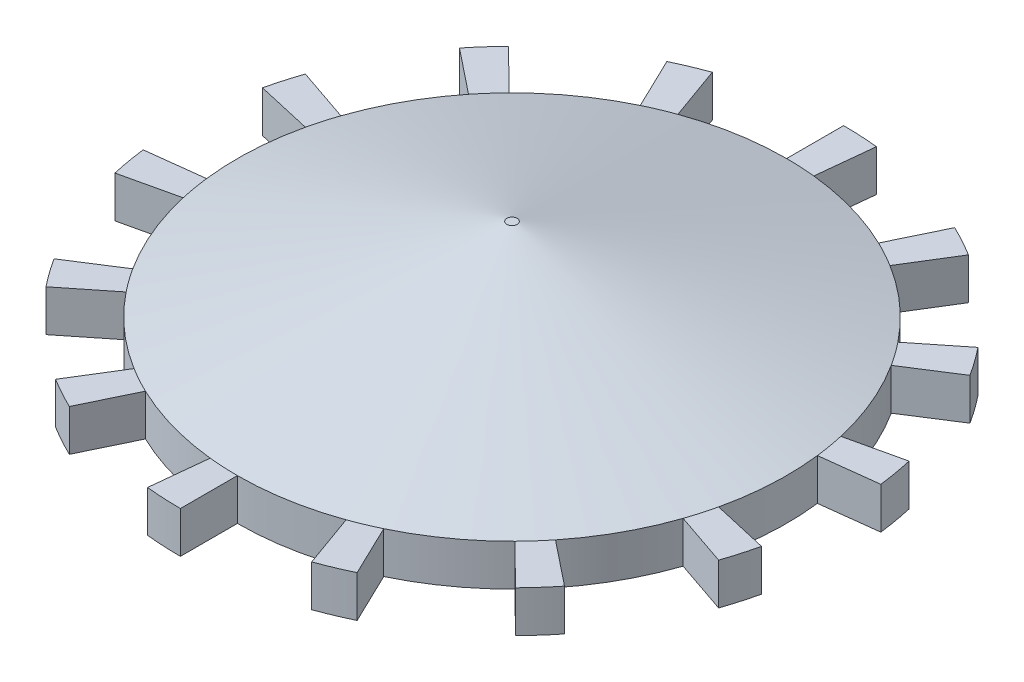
ISO-10303-21;
HEADER;
FILE_DESCRIPTION(('STEP AP214'),'2;1');
FILE_NAME('part.step','',(''),(''),'','','');
FILE_SCHEMA(('AUTOMOTIVE_DESIGN { 1 0 10303 214 1 1 1 1 }'));
ENDSEC;
DATA;
#1=APPLICATION_CONTEXT('core data for automotive mechanical design processes');
#2=APPLICATION_PROTOCOL_DEFINITION('international standard','automotive_design',2000,#1);
#3=PRODUCT_CONTEXT('',#1,'mechanical');
#4=PRODUCT('Part','Part','',(#3));
#5=PRODUCT_RELATED_PRODUCT_CATEGORY('part','',(#4));
#6=PRODUCT_DEFINITION_FORMATION('','',#4);
#7=PRODUCT_DEFINITION_CONTEXT('part definition',#1,'design');
#8=PRODUCT_DEFINITION('design','',#6,#7);
#9=PRODUCT_DEFINITION_SHAPE('','',#8);
#10=(LENGTH_UNIT() NAMED_UNIT(*) SI_UNIT(.MILLI.,.METRE.));
#11=(NAMED_UNIT(*) PLANE_ANGLE_UNIT() SI_UNIT($,.RADIAN.));
#12=(NAMED_UNIT(*) SI_UNIT($,.STERADIAN.) SOLID_ANGLE_UNIT());
#13=UNCERTAINTY_MEASURE_WITH_UNIT(LENGTH_MEASURE(1.E-05),#10,'distance_accuracy_value','');
#14=(GEOMETRIC_REPRESENTATION_CONTEXT(3) GLOBAL_UNCERTAINTY_ASSIGNED_CONTEXT((#13)) GLOBAL_UNIT_ASSIGNED_CONTEXT((#10,
#11,#12)) REPRESENTATION_CONTEXT('',''));
#15=CARTESIAN_POINT('',(0.,0.,0.));
#16=DIRECTION('',(0.,0.,1.));
#17=DIRECTION('',(1.,0.,0.));
#18=AXIS2_PLACEMENT_3D('',#15,#16,#17);
#19=CARTESIAN_POINT('',(0.,12.7,0.));
#20=DIRECTION('',(0.,-1.,0.));
#21=DIRECTION('',(0.,0.,-1.));
#22=AXIS2_PLACEMENT_3D('',#19,#20,#21);
#23=CYLINDRICAL_SURFACE('',#22,33.655);
#24=DIRECTION('',(0.,-1.,0.));
#25=VECTOR('',#24,1.);
#26=CARTESIAN_POINT('',(-3.51790543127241,12.7,33.4706343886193));
#27=LINE('',#26,#25);
#28=CARTESIAN_POINT('',(-3.51790543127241,0.,33.4706343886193));
#29=VERTEX_POINT('',#28);
#30=CARTESIAN_POINT('',(-3.51790543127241,5.08,33.4706343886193));
#31=VERTEX_POINT('',#30);
#32=EDGE_CURVE('E978',#29,#31,#27,.F.);
#33=ORIENTED_EDGE('',*,*,#32,.T.);
#34=CARTESIAN_POINT('',(0.,5.07999999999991,0.));
#35=DIRECTION('',(0.,1.,0.));
#36=DIRECTION('',(0.,0.,1.));
#37=AXIS2_PLACEMENT_3D('',#34,#35,#36);
#38=CIRCLE('',#37,33.655);
#39=CARTESIAN_POINT('',(-14.6023572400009,5.08,30.3221072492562));
#40=VERTEX_POINT('',#39);
#41=EDGE_CURVE('E543',#31,#40,#38,.F.);
#42=ORIENTED_EDGE('',*,*,#41,.T.);
#43=DIRECTION('',(0.,-1.,0.));
#44=VECTOR('',#43,1.);
#45=CARTESIAN_POINT('',(-14.6023572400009,12.7,30.3221072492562));
#46=LINE('',#45,#44);
#47=CARTESIAN_POINT('',(-14.6023572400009,0.,30.3221072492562));
#48=VERTEX_POINT('',#47);
#49=EDGE_CURVE('E643',#40,#48,#46,.T.);
#50=ORIENTED_EDGE('',*,*,#49,.T.);
#51=CARTESIAN_POINT('',(0.,0.,0.));
#52=DIRECTION('',(0.,1.,0.));
#53=DIRECTION('',(0.,0.,1.));
#54=AXIS2_PLACEMENT_3D('',#51,#52,#53);
#55=CIRCLE('',#54,33.655);
#56=EDGE_CURVE('E462',#48,#29,#55,.T.);
#57=ORIENTED_EDGE('',*,*,#56,.T.);
#58=EDGE_LOOP('',(#33,#42,#50,#57));
#59=FACE_BOUND('',#58,.T.);
#60=ADVANCED_FACE('F39',(#59),#23,.T.);
#61=DIRECTION('',(0.,-1.,0.));
#62=VECTOR('',#61,1.);
#63=CARTESIAN_POINT('',(-17.691887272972,12.7,28.6296376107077));
#64=LINE('',#63,#62);
#65=CARTESIAN_POINT('',(-17.691887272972,0.,28.6296376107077));
#66=VERTEX_POINT('',#65);
#67=CARTESIAN_POINT('',(-17.691887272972,5.08,28.6296376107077));
#68=VERTEX_POINT('',#67);
#69=EDGE_CURVE('E640',#66,#68,#64,.F.);
#70=ORIENTED_EDGE('',*,*,#69,.T.);
#71=CARTESIAN_POINT('',(0.,5.07999999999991,0.));
#72=DIRECTION('',(0.,1.,0.));
#73=DIRECTION('',(0.,0.,1.));
#74=AXIS2_PLACEMENT_3D('',#71,#72,#73);
#75=CIRCLE('',#74,33.655);
#76=CARTESIAN_POINT('',(-26.3125385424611,5.08,20.9835492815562));
#77=VERTEX_POINT('',#76);
#78=EDGE_CURVE('E541',#68,#77,#75,.F.);
#79=ORIENTED_EDGE('',*,*,#78,.T.);
#80=DIRECTION('',(0.,-1.,0.));
#81=VECTOR('',#80,1.);
#82=CARTESIAN_POINT('',(-26.3125385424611,12.7,20.9835492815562));
#83=LINE('',#82,#81);
#84=CARTESIAN_POINT('',(-26.3125385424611,0.,20.9835492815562));
#85=VERTEX_POINT('',#84);
#86=EDGE_CURVE('E669',#77,#85,#83,.T.);
#87=ORIENTED_EDGE('',*,*,#86,.T.);
#88=EDGE_CURVE('E986',#85,#66,#55,.T.);
#89=ORIENTED_EDGE('',*,*,#88,.T.);
#90=EDGE_LOOP('',(#70,#79,#87,#89));
#91=FACE_BOUND('',#90,.T.);
#92=ADVANCED_FACE('F1102',(#91),#23,.T.);
#93=DIRECTION('',(0.,-1.,0.));
#94=VECTOR('',#93,1.);
#95=CARTESIAN_POINT('',(-28.3617738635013,12.7,18.1181899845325));
#96=LINE('',#95,#94);
#97=CARTESIAN_POINT('',(-28.3617738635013,0.,18.1181899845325));
#98=VERTEX_POINT('',#97);
#99=CARTESIAN_POINT('',(-28.3617738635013,5.08,18.1181899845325));
#100=VERTEX_POINT('',#99);
#101=EDGE_CURVE('E666',#98,#100,#96,.F.);
#102=ORIENTED_EDGE('',*,*,#101,.T.);
#103=CARTESIAN_POINT('',(0.,5.07999999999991,0.));
#104=DIRECTION('',(0.,1.,0.));
#105=DIRECTION('',(0.,0.,1.));
#106=AXIS2_PLACEMENT_3D('',#103,#104,#105);
#107=CIRCLE('',#106,33.655);
#108=CARTESIAN_POINT('',(-32.8111988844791,5.08,7.48894203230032));
#109=VERTEX_POINT('',#108);
#110=EDGE_CURVE('E539',#100,#109,#107,.F.);
#111=ORIENTED_EDGE('',*,*,#110,.T.);
#112=DIRECTION('',(0.,-1.,0.));
#113=VECTOR('',#112,1.);
#114=CARTESIAN_POINT('',(-32.8111988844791,12.7,7.48894203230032));
#115=LINE('',#114,#113);
#116=CARTESIAN_POINT('',(-32.8111988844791,0.,7.48894203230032));
#117=VERTEX_POINT('',#116);
#118=EDGE_CURVE('E695',#109,#117,#115,.T.);
#119=ORIENTED_EDGE('',*,*,#118,.T.);
#120=EDGE_CURVE('E987',#117,#98,#55,.T.);
#121=ORIENTED_EDGE('',*,*,#120,.T.);
#122=EDGE_LOOP('',(#102,#111,#119,#121));
#123=FACE_BOUND('',#122,.T.);
#124=ADVANCED_FACE('F1107',(#123),#23,.T.);
#125=DIRECTION('',(0.,-1.,0.));
#126=VECTOR('',#125,1.);
#127=CARTESIAN_POINT('',(-33.4142633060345,12.7,4.01821262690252));
#128=LINE('',#127,#126);
#129=CARTESIAN_POINT('',(-33.4142633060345,0.,4.01821262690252));
#130=VERTEX_POINT('',#129);
#131=CARTESIAN_POINT('',(-33.4142633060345,5.08,4.01821262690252));
#132=VERTEX_POINT('',#131);
#133=EDGE_CURVE('E692',#130,#132,#128,.F.);
#134=ORIENTED_EDGE('',*,*,#133,.T.);
#135=CARTESIAN_POINT('',(0.,5.07999999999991,0.));
#136=DIRECTION('',(0.,1.,0.));
#137=DIRECTION('',(0.,0.,1.));
#138=AXIS2_PLACEMENT_3D('',#135,#136,#137);
#139=CIRCLE('',#138,33.655);
#140=CARTESIAN_POINT('',(-32.8111988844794,5.08,-7.48894203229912));
#141=VERTEX_POINT('',#140);
#142=EDGE_CURVE('E537',#132,#141,#139,.F.);
#143=ORIENTED_EDGE('',*,*,#142,.T.);
#144=DIRECTION('',(0.,-1.,0.));
#145=VECTOR('',#144,1.);
#146=CARTESIAN_POINT('',(-32.8111988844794,12.7,-7.48894203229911));
#147=LINE('',#146,#145);
#148=CARTESIAN_POINT('',(-32.8111988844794,0.,-7.48894203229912));
#149=VERTEX_POINT('',#148);
#150=EDGE_CURVE('E721',#141,#149,#147,.T.);
#151=ORIENTED_EDGE('',*,*,#150,.T.);
#152=EDGE_CURVE('E990',#149,#130,#55,.T.);
#153=ORIENTED_EDGE('',*,*,#152,.T.);
#154=EDGE_LOOP('',(#134,#143,#151,#153));
#155=FACE_BOUND('',#154,.T.);
#156=ADVANCED_FACE('F1274',(#155),#23,.T.);
#157=DIRECTION('',(0.,-1.,0.));
#158=VECTOR('',#157,1.);
#159=CARTESIAN_POINT('',(-31.848648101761,12.7,-10.8776210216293));
#160=LINE('',#159,#158);
#161=CARTESIAN_POINT('',(-31.8486481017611,0.,-10.8776210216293));
#162=VERTEX_POINT('',#161);
#163=CARTESIAN_POINT('',(-31.8486481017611,5.08,-10.8776210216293));
#164=VERTEX_POINT('',#163);
#165=EDGE_CURVE('E718',#162,#164,#160,.F.);
#166=ORIENTED_EDGE('',*,*,#165,.T.);
#167=CARTESIAN_POINT('',(0.,5.07999999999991,0.));
#168=DIRECTION('',(0.,1.,0.));
#169=DIRECTION('',(0.,0.,1.));
#170=AXIS2_PLACEMENT_3D('',#167,#168,#169);
#171=CIRCLE('',#170,33.655);
#172=CARTESIAN_POINT('',(-26.3125385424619,5.08,-20.9835492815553));
#173=VERTEX_POINT('',#172);
#174=EDGE_CURVE('E535',#164,#173,#171,.F.);
#175=ORIENTED_EDGE('',*,*,#174,.T.);
#176=DIRECTION('',(0.,-1.,0.));
#177=VECTOR('',#176,1.);
#178=CARTESIAN_POINT('',(-26.3125385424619,12.7,-20.9835492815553));
#179=LINE('',#178,#177);
#180=CARTESIAN_POINT('',(-26.3125385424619,0.,-20.9835492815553));
#181=VERTEX_POINT('',#180);
#182=EDGE_CURVE('E747',#173,#181,#179,.T.);
#183=ORIENTED_EDGE('',*,*,#182,.T.);
#184=EDGE_CURVE('E993',#181,#162,#55,.T.);
#185=ORIENTED_EDGE('',*,*,#184,.T.);
#186=EDGE_LOOP('',(#166,#175,#183,#185));
#187=FACE_BOUND('',#186,.T.);
#188=ADVANCED_FACE('F1254',(#187),#23,.T.);
#189=DIRECTION('',(0.,-1.,0.));
#190=VECTOR('',#189,1.);
#191=CARTESIAN_POINT('',(-23.9750175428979,12.7,-23.6190084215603));
#192=LINE('',#191,#190);
#193=CARTESIAN_POINT('',(-23.9750175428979,0.,-23.6190084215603));
#194=VERTEX_POINT('',#193);
#195=CARTESIAN_POINT('',(-23.9750175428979,5.08,-23.6190084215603));
#196=VERTEX_POINT('',#195);
#197=EDGE_CURVE('E744',#194,#196,#192,.F.);
#198=ORIENTED_EDGE('',*,*,#197,.T.);
#199=CARTESIAN_POINT('',(0.,5.07999999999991,0.));
#200=DIRECTION('',(0.,1.,0.));
#201=DIRECTION('',(0.,0.,1.));
#202=AXIS2_PLACEMENT_3D('',#199,#200,#201);
#203=CIRCLE('',#202,33.655);
#204=CARTESIAN_POINT('',(-14.6023572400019,5.08,-30.3221072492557));
#205=VERTEX_POINT('',#204);
#206=EDGE_CURVE('E533',#196,#205,#203,.F.);
#207=ORIENTED_EDGE('',*,*,#206,.T.);
#208=DIRECTION('',(0.,-1.,0.));
#209=VECTOR('',#208,1.);
#210=CARTESIAN_POINT('',(-14.6023572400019,12.7,-30.3221072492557));
#211=LINE('',#210,#209);
#212=CARTESIAN_POINT('',(-14.6023572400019,0.,-30.3221072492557));
#213=VERTEX_POINT('',#212);
#214=EDGE_CURVE('E773',#205,#213,#211,.T.);
#215=ORIENTED_EDGE('',*,*,#214,.T.);
#216=EDGE_CURVE('E996',#213,#194,#55,.T.);
#217=ORIENTED_EDGE('',*,*,#216,.T.);
#218=EDGE_LOOP('',(#198,#207,#215,#217));
#219=FACE_BOUND('',#218,.T.);
#220=ADVANCED_FACE('F1236',(#219),#23,.T.);
#221=DIRECTION('',(0.,-1.,0.));
#222=VECTOR('',#221,1.);
#223=CARTESIAN_POINT('',(-11.3528407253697,12.7,-31.6823615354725));
#224=LINE('',#223,#222);
#225=CARTESIAN_POINT('',(-11.3528407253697,0.,-31.6823615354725));
#226=VERTEX_POINT('',#225);
#227=CARTESIAN_POINT('',(-11.3528407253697,5.08,-31.6823615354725));
#228=VERTEX_POINT('',#227);
#229=EDGE_CURVE('E770',#226,#228,#224,.F.);
#230=ORIENTED_EDGE('',*,*,#229,.T.);
#231=CARTESIAN_POINT('',(0.,5.07999999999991,0.));
#232=DIRECTION('',(0.,1.,0.));
#233=DIRECTION('',(0.,0.,1.));
#234=AXIS2_PLACEMENT_3D('',#231,#232,#233);
#235=CIRCLE('',#234,33.655);
#236=CARTESIAN_POINT('',(-6.13449913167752E-13,5.08,-33.655));
#237=VERTEX_POINT('',#236);
#238=EDGE_CURVE('E531',#228,#237,#235,.F.);
#239=ORIENTED_EDGE('',*,*,#238,.T.);
#240=DIRECTION('',(0.,-1.,0.));
#241=VECTOR('',#240,1.);
#242=CARTESIAN_POINT('',(-6.13449913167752E-13,12.7,-33.655));
#243=LINE('',#242,#241);
#244=CARTESIAN_POINT('',(-6.13449913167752E-13,0.,-33.655));
#245=VERTEX_POINT('',#244);
#246=EDGE_CURVE('E799',#237,#245,#243,.T.);
#247=ORIENTED_EDGE('',*,*,#246,.T.);
#248=EDGE_CURVE('E999',#245,#226,#55,.T.);
#249=ORIENTED_EDGE('',*,*,#248,.T.);
#250=EDGE_LOOP('',(#230,#239,#247,#249));
#251=FACE_BOUND('',#250,.T.);
#252=ADVANCED_FACE('F1216',(#251),#23,.T.);
#253=DIRECTION('',(0.,-1.,0.));
#254=VECTOR('',#253,1.);
#255=CARTESIAN_POINT('',(3.51790543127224,12.7,-33.4706343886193));
#256=LINE('',#255,#254);
#257=CARTESIAN_POINT('',(3.51790543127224,0.,-33.4706343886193));
#258=VERTEX_POINT('',#257);
#259=CARTESIAN_POINT('',(3.51790543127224,5.08,-33.4706343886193));
#260=VERTEX_POINT('',#259);
#261=EDGE_CURVE('E796',#258,#260,#256,.F.);
#262=ORIENTED_EDGE('',*,*,#261,.T.);
#263=CARTESIAN_POINT('',(0.,5.07999999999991,0.));
#264=DIRECTION('',(0.,1.,0.));
#265=DIRECTION('',(0.,0.,1.));
#266=AXIS2_PLACEMENT_3D('',#263,#264,#265);
#267=CIRCLE('',#266,33.655);
#268=CARTESIAN_POINT('',(14.6023572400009,5.08,-30.3221072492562));
#269=VERTEX_POINT('',#268);
#270=EDGE_CURVE('E529',#260,#269,#267,.F.);
#271=ORIENTED_EDGE('',*,*,#270,.T.);
#272=DIRECTION('',(0.,-1.,0.));
#273=VECTOR('',#272,1.);
#274=CARTESIAN_POINT('',(14.6023572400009,12.7,-30.3221072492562));
#275=LINE('',#274,#273);
#276=CARTESIAN_POINT('',(14.6023572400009,0.,-30.3221072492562));
#277=VERTEX_POINT('',#276);
#278=EDGE_CURVE('E825',#269,#277,#275,.T.);
#279=ORIENTED_EDGE('',*,*,#278,.T.);
#280=EDGE_CURVE('E1002',#277,#258,#55,.T.);
#281=ORIENTED_EDGE('',*,*,#280,.T.);
#282=EDGE_LOOP('',(#262,#271,#279,#281));
#283=FACE_BOUND('',#282,.T.);
#284=ADVANCED_FACE('F1198',(#283),#23,.T.);
#285=DIRECTION('',(0.,-1.,0.));
#286=VECTOR('',#285,1.);
#287=CARTESIAN_POINT('',(17.691887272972,12.7,-28.6296376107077));
#288=LINE('',#287,#286);
#289=CARTESIAN_POINT('',(17.691887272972,0.,-28.6296376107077));
#290=VERTEX_POINT('',#289);
#291=CARTESIAN_POINT('',(17.691887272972,5.08,-28.6296376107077));
#292=VERTEX_POINT('',#291);
#293=EDGE_CURVE('E822',#290,#292,#288,.F.);
#294=ORIENTED_EDGE('',*,*,#293,.T.);
#295=CARTESIAN_POINT('',(0.,5.07999999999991,0.));
#296=DIRECTION('',(0.,1.,0.));
#297=DIRECTION('',(0.,0.,1.));
#298=AXIS2_PLACEMENT_3D('',#295,#296,#297);
#299=CIRCLE('',#298,33.655);
#300=CARTESIAN_POINT('',(26.3125385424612,5.08,-20.9835492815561));
#301=VERTEX_POINT('',#300);
#302=EDGE_CURVE('E527',#292,#301,#299,.F.);
#303=ORIENTED_EDGE('',*,*,#302,.T.);
#304=DIRECTION('',(0.,-1.,0.));
#305=VECTOR('',#304,1.);
#306=CARTESIAN_POINT('',(26.3125385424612,12.7,-20.9835492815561));
#307=LINE('',#306,#305);
#308=CARTESIAN_POINT('',(26.3125385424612,0.,-20.9835492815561));
#309=VERTEX_POINT('',#308);
#310=EDGE_CURVE('E851',#301,#309,#307,.T.);
#311=ORIENTED_EDGE('',*,*,#310,.T.);
#312=EDGE_CURVE('E1005',#309,#290,#55,.T.);
#313=ORIENTED_EDGE('',*,*,#312,.T.);
#314=EDGE_LOOP('',(#294,#303,#311,#313));
#315=FACE_BOUND('',#314,.T.);
#316=ADVANCED_FACE('F1178',(#315),#23,.T.);
#317=DIRECTION('',(0.,-1.,0.));
#318=VECTOR('',#317,1.);
#319=CARTESIAN_POINT('',(28.3617738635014,12.7,-18.1181899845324));
#320=LINE('',#319,#318);
#321=CARTESIAN_POINT('',(28.3617738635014,0.,-18.1181899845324));
#322=VERTEX_POINT('',#321);
#323=CARTESIAN_POINT('',(28.3617738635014,5.08,-18.1181899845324));
#324=VERTEX_POINT('',#323);
#325=EDGE_CURVE('E848',#322,#324,#320,.F.);
#326=ORIENTED_EDGE('',*,*,#325,.T.);
#327=CARTESIAN_POINT('',(0.,5.07999999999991,0.));
#328=DIRECTION('',(0.,1.,0.));
#329=DIRECTION('',(0.,0.,1.));
#330=AXIS2_PLACEMENT_3D('',#327,#328,#329);
#331=CIRCLE('',#330,33.655);
#332=CARTESIAN_POINT('',(32.8111988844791,5.08,-7.48894203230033));
#333=VERTEX_POINT('',#332);
#334=EDGE_CURVE('E525',#324,#333,#331,.F.);
#335=ORIENTED_EDGE('',*,*,#334,.T.);
#336=DIRECTION('',(0.,-1.,0.));
#337=VECTOR('',#336,1.);
#338=CARTESIAN_POINT('',(32.8111988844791,12.7,-7.48894203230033));
#339=LINE('',#338,#337);
#340=CARTESIAN_POINT('',(32.8111988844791,0.,-7.48894203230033));
#341=VERTEX_POINT('',#340);
#342=EDGE_CURVE('E877',#333,#341,#339,.T.);
#343=ORIENTED_EDGE('',*,*,#342,.T.);
#344=EDGE_CURVE('E1008',#341,#322,#55,.T.);
#345=ORIENTED_EDGE('',*,*,#344,.T.);
#346=EDGE_LOOP('',(#326,#335,#343,#345));
#347=FACE_BOUND('',#346,.T.);
#348=ADVANCED_FACE('F1123',(#347),#23,.T.);
#349=DIRECTION('',(0.,-1.,0.));
#350=VECTOR('',#349,1.);
#351=CARTESIAN_POINT('',(33.4142633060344,12.7,-4.01821262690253));
#352=LINE('',#351,#350);
#353=CARTESIAN_POINT('',(33.4142633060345,0.,-4.01821262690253));
#354=VERTEX_POINT('',#353);
#355=CARTESIAN_POINT('',(33.4142633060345,5.08,-4.01821262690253));
#356=VERTEX_POINT('',#355);
#357=EDGE_CURVE('E874',#354,#356,#352,.F.);
#358=ORIENTED_EDGE('',*,*,#357,.T.);
#359=CARTESIAN_POINT('',(0.,5.07999999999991,0.));
#360=DIRECTION('',(0.,1.,0.));
#361=DIRECTION('',(0.,0.,1.));
#362=AXIS2_PLACEMENT_3D('',#359,#360,#361);
#363=CIRCLE('',#362,33.655);
#364=CARTESIAN_POINT('',(32.8111988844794,5.08,7.4889420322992));
#365=VERTEX_POINT('',#364);
#366=EDGE_CURVE('E523',#356,#365,#363,.F.);
#367=ORIENTED_EDGE('',*,*,#366,.T.);
#368=DIRECTION('',(0.,-1.,0.));
#369=VECTOR('',#368,1.);
#370=CARTESIAN_POINT('',(32.8111988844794,12.7,7.4889420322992));
#371=LINE('',#370,#369);
#372=CARTESIAN_POINT('',(32.8111988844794,0.,7.4889420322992));
#373=VERTEX_POINT('',#372);
#374=EDGE_CURVE('E903',#365,#373,#371,.T.);
#375=ORIENTED_EDGE('',*,*,#374,.T.);
#376=EDGE_CURVE('E1011',#373,#354,#55,.T.);
#377=ORIENTED_EDGE('',*,*,#376,.T.);
#378=EDGE_LOOP('',(#358,#367,#375,#377));
#379=FACE_BOUND('',#378,.T.);
#380=ADVANCED_FACE('F1119',(#379),#23,.T.);
#381=DIRECTION('',(0.,-1.,0.));
#382=VECTOR('',#381,1.);
#383=CARTESIAN_POINT('',(31.8486481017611,12.7,10.8776210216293));
#384=LINE('',#383,#382);
#385=CARTESIAN_POINT('',(31.8486481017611,0.,10.8776210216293));
#386=VERTEX_POINT('',#385);
#387=CARTESIAN_POINT('',(31.8486481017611,5.08,10.8776210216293));
#388=VERTEX_POINT('',#387);
#389=EDGE_CURVE('E900',#386,#388,#384,.F.);
#390=ORIENTED_EDGE('',*,*,#389,.T.);
#391=CARTESIAN_POINT('',(0.,5.07999999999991,0.));
#392=DIRECTION('',(0.,1.,0.));
#393=DIRECTION('',(0.,0.,1.));
#394=AXIS2_PLACEMENT_3D('',#391,#392,#393);
#395=CIRCLE('',#394,33.655);
#396=CARTESIAN_POINT('',(26.3125385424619,5.08,20.9835492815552));
#397=VERTEX_POINT('',#396);
#398=EDGE_CURVE('E521',#388,#397,#395,.F.);
#399=ORIENTED_EDGE('',*,*,#398,.T.);
#400=DIRECTION('',(0.,-1.,0.));
#401=VECTOR('',#400,1.);
#402=CARTESIAN_POINT('',(26.3125385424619,12.7,20.9835492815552));
#403=LINE('',#402,#401);
#404=CARTESIAN_POINT('',(26.3125385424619,0.,20.9835492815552));
#405=VERTEX_POINT('',#404);
#406=EDGE_CURVE('E929',#397,#405,#403,.T.);
#407=ORIENTED_EDGE('',*,*,#406,.T.);
#408=EDGE_CURVE('E1014',#405,#386,#55,.T.);
#409=ORIENTED_EDGE('',*,*,#408,.T.);
#410=EDGE_LOOP('',(#390,#399,#407,#409));
#411=FACE_BOUND('',#410,.T.);
#412=ADVANCED_FACE('F1115',(#411),#23,.T.);
#413=DIRECTION('',(0.,-1.,0.));
#414=VECTOR('',#413,1.);
#415=CARTESIAN_POINT('',(23.9750175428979,12.7,23.6190084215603));
#416=LINE('',#415,#414);
#417=CARTESIAN_POINT('',(23.9750175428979,0.,23.6190084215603));
#418=VERTEX_POINT('',#417);
#419=CARTESIAN_POINT('',(23.9750175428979,5.08,23.6190084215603));
#420=VERTEX_POINT('',#419);
#421=EDGE_CURVE('E926',#418,#420,#416,.F.);
#422=ORIENTED_EDGE('',*,*,#421,.T.);
#423=CARTESIAN_POINT('',(0.,5.07999999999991,0.));
#424=DIRECTION('',(0.,1.,0.));
#425=DIRECTION('',(0.,0.,1.));
#426=AXIS2_PLACEMENT_3D('',#423,#424,#425);
#427=CIRCLE('',#426,33.655);
#428=CARTESIAN_POINT('',(14.6023572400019,5.08,30.3221072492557));
#429=VERTEX_POINT('',#428);
#430=EDGE_CURVE('E519',#420,#429,#427,.F.);
#431=ORIENTED_EDGE('',*,*,#430,.T.);
#432=DIRECTION('',(0.,-1.,0.));
#433=VECTOR('',#432,1.);
#434=CARTESIAN_POINT('',(14.6023572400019,12.7,30.3221072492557));
#435=LINE('',#434,#433);
#436=CARTESIAN_POINT('',(14.6023572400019,0.,30.3221072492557));
#437=VERTEX_POINT('',#436);
#438=EDGE_CURVE('E955',#429,#437,#435,.T.);
#439=ORIENTED_EDGE('',*,*,#438,.T.);
#440=EDGE_CURVE('E460',#437,#418,#55,.T.);
#441=ORIENTED_EDGE('',*,*,#440,.T.);
#442=EDGE_LOOP('',(#422,#431,#439,#441));
#443=FACE_BOUND('',#442,.T.);
#444=ADVANCED_FACE('F1021',(#443),#23,.T.);
#445=DIRECTION('',(0.,-1.,0.));
#446=VECTOR('',#445,1.);
#447=CARTESIAN_POINT('',(11.3528407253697,12.7,31.6823615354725));
#448=LINE('',#447,#446);
#449=CARTESIAN_POINT('',(11.3528407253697,0.,31.6823615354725));
#450=VERTEX_POINT('',#449);
#451=CARTESIAN_POINT('',(11.3528407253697,5.08,31.6823615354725));
#452=VERTEX_POINT('',#451);
#453=EDGE_CURVE('E952',#450,#452,#448,.F.);
#454=ORIENTED_EDGE('',*,*,#453,.T.);
#455=CARTESIAN_POINT('',(0.,5.07999999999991,0.));
#456=DIRECTION('',(0.,1.,0.));
#457=DIRECTION('',(0.,0.,1.));
#458=AXIS2_PLACEMENT_3D('',#455,#456,#457);
#459=CIRCLE('',#458,33.655);
#460=CARTESIAN_POINT('',(4.35971959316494E-13,5.08,33.655));
#461=VERTEX_POINT('',#460);
#462=EDGE_CURVE('E517',#452,#461,#459,.F.);
#463=ORIENTED_EDGE('',*,*,#462,.T.);
#464=DIRECTION('',(0.,-1.,0.));
#465=VECTOR('',#464,1.);
#466=CARTESIAN_POINT('',(4.35971959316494E-13,12.7,33.655));
#467=LINE('',#466,#465);
#468=CARTESIAN_POINT('',(4.35971959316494E-13,0.,33.655));
#469=VERTEX_POINT('',#468);
#470=EDGE_CURVE('E464',#461,#469,#467,.T.);
#471=ORIENTED_EDGE('',*,*,#470,.T.);
#472=EDGE_CURVE('E457',#469,#450,#55,.T.);
#473=ORIENTED_EDGE('',*,*,#472,.T.);
#474=EDGE_LOOP('',(#454,#463,#471,#473));
#475=FACE_BOUND('',#474,.T.);
#476=ADVANCED_FACE('F1061',(#475),#23,.T.);
#477=CARTESIAN_POINT('',(0.,0.,0.));
#478=DIRECTION('',(0.,1.,0.));
#479=DIRECTION('',(0.,0.,1.));
#480=AXIS2_PLACEMENT_3D('',#477,#478,#479);
#481=PLANE('',#480);
#482=CARTESIAN_POINT('',(0.,0.,0.));
#483=DIRECTION('',(0.,-1.,0.));
#484=DIRECTION('',(0.,0.,-1.));
#485=AXIS2_PLACEMENT_3D('',#482,#483,#484);
#486=CIRCLE('',#485,25.4);
#487=CARTESIAN_POINT('',(0.,0.,-25.4));
#488=VERTEX_POINT('',#487);
#489=EDGE_CURVE('E612',#488,#488,#486,.T.);
#490=ORIENTED_EDGE('',*,*,#489,.F.);
#491=EDGE_LOOP('',(#490));
#492=FACE_BOUND('',#491,.T.);
#493=ORIENTED_EDGE('',*,*,#56,.F.);
#494=DIRECTION('',(-0.433883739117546,0.,0.900968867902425));
#495=VECTOR('',#494,1.);
#496=CARTESIAN_POINT('',(-9.0212066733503,0.,18.732728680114));
#497=LINE('',#496,#495);
#498=CARTESIAN_POINT('',(-17.633035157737,0.,36.6153747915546));
#499=VERTEX_POINT('',#498);
#500=EDGE_CURVE('E625',#48,#499,#497,.T.);
#501=ORIENTED_EDGE('',*,*,#500,.T.);
#502=CARTESIAN_POINT('',(0.,0.,0.));
#503=DIRECTION('',(0.,-1.,0.));
#504=DIRECTION('',(0.,0.,-1.));
#505=AXIS2_PLACEMENT_3D('',#502,#503,#504);
#506=CIRCLE('',#505,40.64);
#507=CARTESIAN_POINT('',(-21.3637884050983,0.,34.5716378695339));
#508=VERTEX_POINT('',#507);
#509=EDGE_CURVE('E618',#499,#508,#506,.T.);
#510=ORIENTED_EDGE('',*,*,#509,.T.);
#511=DIRECTION('',(0.525683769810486,0.,-0.850680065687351));
#512=VECTOR('',#511,1.);
#513=CARTESIAN_POINT('',(-10.9298909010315,0.,17.6871359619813));
#514=LINE('',#513,#512);
#515=EDGE_CURVE('E633',#508,#66,#514,.T.);
#516=ORIENTED_EDGE('',*,*,#515,.T.);
#517=ORIENTED_EDGE('',*,*,#88,.F.);
#518=DIRECTION('',(-0.78183148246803,0.,0.623489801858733));
#519=VECTOR('',#518,1.);
#520=CARTESIAN_POINT('',(-16.2556527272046,0.,12.9634504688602));
#521=LINE('',#520,#519);
#522=CARTESIAN_POINT('',(-31.7736314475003,0.,25.3386255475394));
#523=VERTEX_POINT('',#522);
#524=EDGE_CURVE('E651',#85,#523,#521,.T.);
#525=ORIENTED_EDGE('',*,*,#524,.T.);
#526=CARTESIAN_POINT('',(0.,0.,0.));
#527=DIRECTION('',(0.,-1.,0.));
#528=DIRECTION('',(0.,0.,-1.));
#529=AXIS2_PLACEMENT_3D('',#526,#527,#528);
#530=CIRCLE('',#529,40.64);
#531=CARTESIAN_POINT('',(-34.2481797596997,0.,21.878569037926));
#532=VERTEX_POINT('',#531);
#533=EDGE_CURVE('E646',#523,#532,#530,.T.);
#534=ORIENTED_EDGE('',*,*,#533,.T.);
#535=DIRECTION('',(0.842720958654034,0.,-0.53835061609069));
#536=VECTOR('',#535,1.);
#537=CARTESIAN_POINT('',(-17.5216521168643,0.,11.1932569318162));
#538=LINE('',#537,#536);
#539=EDGE_CURVE('E659',#532,#98,#538,.T.);
#540=ORIENTED_EDGE('',*,*,#539,.T.);
#541=ORIENTED_EDGE('',*,*,#120,.F.);
#542=DIRECTION('',(-0.974927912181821,0.,0.222520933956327));
#543=VECTOR('',#542,1.);
#544=CARTESIAN_POINT('',(-20.2704673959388,0.,4.62660190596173));
#545=LINE('',#544,#543);
#546=CARTESIAN_POINT('',(-39.6210703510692,0.,9.04325075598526));
#547=VERTEX_POINT('',#546);
#548=EDGE_CURVE('E677',#117,#547,#545,.T.);
#549=ORIENTED_EDGE('',*,*,#548,.T.);
#550=CARTESIAN_POINT('',(0.,0.,0.));
#551=DIRECTION('',(0.,-1.,0.));
#552=DIRECTION('',(0.,0.,-1.));
#553=AXIS2_PLACEMENT_3D('',#550,#551,#552);
#554=CIRCLE('',#553,40.64);
#555=CARTESIAN_POINT('',(-40.3492990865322,0.,4.85218128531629));
#556=VERTEX_POINT('',#555);
#557=EDGE_CURVE('E672',#547,#556,#554,.T.);
#558=ORIENTED_EDGE('',*,*,#557,.T.);
#559=DIRECTION('',(0.992846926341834,0.,-0.119394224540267));
#560=VECTOR('',#559,1.);
#561=CARTESIAN_POINT('',(-20.6430352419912,0.,2.48241609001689));
#562=LINE('',#561,#560);
#563=EDGE_CURVE('E685',#556,#130,#562,.T.);
#564=ORIENTED_EDGE('',*,*,#563,.T.);
#565=ORIENTED_EDGE('',*,*,#152,.F.);
#566=DIRECTION('',(-0.974927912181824,0.,-0.222520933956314));
#567=VECTOR('',#566,1.);
#568=CARTESIAN_POINT('',(-20.270467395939,0.,-4.62660190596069));
#569=LINE('',#568,#567);
#570=CARTESIAN_POINT('',(-39.6210703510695,0.,-9.04325075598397));
#571=VERTEX_POINT('',#570);
#572=EDGE_CURVE('E703',#149,#571,#569,.T.);
#573=ORIENTED_EDGE('',*,*,#572,.T.);
#574=CARTESIAN_POINT('',(0.,0.,0.));
#575=DIRECTION('',(0.,-1.,0.));
#576=DIRECTION('',(0.,0.,-1.));
#577=AXIS2_PLACEMENT_3D('',#574,#575,#576);
#578=CIRCLE('',#577,40.64);
#579=CARTESIAN_POINT('',(-38.4587448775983,0.,-13.1352404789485));
#580=VERTEX_POINT('',#579);
#581=EDGE_CURVE('E698',#571,#580,#578,.T.);
#582=ORIENTED_EDGE('',*,*,#581,.T.);
#583=DIRECTION('',(0.946327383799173,0.,0.323209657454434));
#584=VECTOR('',#583,1.);
#585=CARTESIAN_POINT('',(-19.6758120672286,0.,-6.72009770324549));
#586=LINE('',#585,#584);
#587=EDGE_CURVE('E711',#580,#162,#586,.T.);
#588=ORIENTED_EDGE('',*,*,#587,.T.);
#589=ORIENTED_EDGE('',*,*,#184,.F.);
#590=DIRECTION('',(-0.781831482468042,0.,-0.623489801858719));
#591=VECTOR('',#590,1.);
#592=CARTESIAN_POINT('',(-16.2556527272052,0.,-12.9634504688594));
#593=LINE('',#592,#591);
#594=CARTESIAN_POINT('',(-31.7736314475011,0.,-25.3386255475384));
#595=VERTEX_POINT('',#594);
#596=EDGE_CURVE('E729',#181,#595,#593,.T.);
#597=ORIENTED_EDGE('',*,*,#596,.T.);
#598=CARTESIAN_POINT('',(0.,0.,0.));
#599=DIRECTION('',(0.,-1.,0.));
#600=DIRECTION('',(0.,0.,-1.));
#601=AXIS2_PLACEMENT_3D('',#598,#599,#600);
#602=CIRCLE('',#601,40.64);
#603=CARTESIAN_POINT('',(-28.9509645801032,0.,-28.5210667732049));
#604=VERTEX_POINT('',#603);
#605=EDGE_CURVE('E724',#595,#604,#602,.T.);
#606=ORIENTED_EDGE('',*,*,#605,.T.);
#607=DIRECTION('',(0.712376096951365,0.,0.701797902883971));
#608=VECTOR('',#607,1.);
#609=CARTESIAN_POINT('',(-14.8115530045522,0.,-14.5916137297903));
#610=LINE('',#609,#608);
#611=EDGE_CURVE('E737',#604,#194,#610,.T.);
#612=ORIENTED_EDGE('',*,*,#611,.T.);
#613=ORIENTED_EDGE('',*,*,#216,.F.);
#614=DIRECTION('',(-0.433883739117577,0.,-0.90096886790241));
#615=VECTOR('',#614,1.);
#616=CARTESIAN_POINT('',(-9.0212066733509,0.,-18.7327286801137));
#617=LINE('',#616,#615);
#618=CARTESIAN_POINT('',(-17.6330351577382,0.,-36.615374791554));
#619=VERTEX_POINT('',#618);
#620=EDGE_CURVE('E755',#213,#619,#617,.T.);
#621=ORIENTED_EDGE('',*,*,#620,.T.);
#622=CARTESIAN_POINT('',(0.,0.,0.));
#623=DIRECTION('',(0.,-1.,0.));
#624=DIRECTION('',(0.,0.,-1.));
#625=AXIS2_PLACEMENT_3D('',#622,#623,#624);
#626=CIRCLE('',#625,40.64);
#627=CARTESIAN_POINT('',(-13.7090906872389,0.,-38.2579460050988));
#628=VERTEX_POINT('',#627);
#629=EDGE_CURVE('E750',#619,#628,#626,.T.);
#630=ORIENTED_EDGE('',*,*,#629,.T.);
#631=DIRECTION('',(0.337329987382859,0.,0.941386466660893));
#632=VECTOR('',#631,1.);
#633=CARTESIAN_POINT('',(-7.01368421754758,0.,-19.5730817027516));
#634=LINE('',#633,#632);
#635=EDGE_CURVE('E763',#628,#226,#634,.T.);
#636=ORIENTED_EDGE('',*,*,#635,.T.);
#637=ORIENTED_EDGE('',*,*,#248,.F.);
#638=DIRECTION('',(0.,0.,-1.));
#639=VECTOR('',#638,1.);
#640=CARTESIAN_POINT('',(-5.13478148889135E-13,0.,-20.791760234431));
#641=LINE('',#640,#639);
#642=CARTESIAN_POINT('',(-6.67736608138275E-13,0.,-40.64));
#643=VERTEX_POINT('',#642);
#644=EDGE_CURVE('E781',#245,#643,#641,.T.);
#645=ORIENTED_EDGE('',*,*,#644,.T.);
#646=CARTESIAN_POINT('',(0.,0.,0.));
#647=DIRECTION('',(0.,-1.,0.));
#648=DIRECTION('',(0.,0.,-1.));
#649=AXIS2_PLACEMENT_3D('',#646,#647,#648);
#650=CIRCLE('',#649,40.64);
#651=CARTESIAN_POINT('',(4.24803674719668,0.,-40.4173698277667));
#652=VERTEX_POINT('',#651);
#653=EDGE_CURVE('E776',#643,#652,#650,.T.);
#654=ORIENTED_EDGE('',*,*,#653,.T.);
#655=DIRECTION('',(-0.104528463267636,0.,0.994521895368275));
#656=VECTOR('',#655,1.);
#657=CARTESIAN_POINT('',(2.17333074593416,0.,-20.677860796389));
#658=LINE('',#657,#656);
#659=EDGE_CURVE('E789',#652,#258,#658,.T.);
#660=ORIENTED_EDGE('',*,*,#659,.T.);
#661=ORIENTED_EDGE('',*,*,#280,.F.);
#662=DIRECTION('',(0.43388373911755,0.,-0.900968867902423));
#663=VECTOR('',#662,1.);
#664=CARTESIAN_POINT('',(9.02120667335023,0.,-18.732728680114));
#665=LINE('',#664,#663);
#666=CARTESIAN_POINT('',(17.633035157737,0.,-36.6153747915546));
#667=VERTEX_POINT('',#666);
#668=EDGE_CURVE('E807',#277,#667,#665,.T.);
#669=ORIENTED_EDGE('',*,*,#668,.T.);
#670=CARTESIAN_POINT('',(0.,0.,0.));
#671=DIRECTION('',(0.,-1.,0.));
#672=DIRECTION('',(0.,0.,-1.));
#673=AXIS2_PLACEMENT_3D('',#670,#671,#672);
#674=CIRCLE('',#673,40.64);
#675=CARTESIAN_POINT('',(21.3637884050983,0.,-34.5716378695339));
#676=VERTEX_POINT('',#675);
#677=EDGE_CURVE('E802',#667,#676,#674,.T.);
#678=ORIENTED_EDGE('',*,*,#677,.T.);
#679=DIRECTION('',(-0.525683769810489,0.,0.850680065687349));
#680=VECTOR('',#679,1.);
#681=CARTESIAN_POINT('',(10.9298909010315,0.,-17.6871359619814));
#682=LINE('',#681,#680);
#683=EDGE_CURVE('E815',#676,#290,#682,.T.);
#684=ORIENTED_EDGE('',*,*,#683,.T.);
#685=ORIENTED_EDGE('',*,*,#312,.F.);
#686=DIRECTION('',(0.781831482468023,0.,-0.623489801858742));
#687=VECTOR('',#686,1.);
#688=CARTESIAN_POINT('',(16.2556527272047,0.,-12.96345046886));
#689=LINE('',#688,#687);
#690=CARTESIAN_POINT('',(31.7736314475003,0.,-25.3386255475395));
#691=VERTEX_POINT('',#690);
#692=EDGE_CURVE('E833',#309,#691,#689,.T.);
#693=ORIENTED_EDGE('',*,*,#692,.T.);
#694=CARTESIAN_POINT('',(0.,0.,0.));
#695=DIRECTION('',(0.,-1.,0.));
#696=DIRECTION('',(0.,0.,-1.));
#697=AXIS2_PLACEMENT_3D('',#694,#695,#696);
#698=CIRCLE('',#697,40.64);
#699=CARTESIAN_POINT('',(34.2481797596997,0.,-21.878569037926));
#700=VERTEX_POINT('',#699);
#701=EDGE_CURVE('E828',#691,#700,#698,.T.);
#702=ORIENTED_EDGE('',*,*,#701,.T.);
#703=DIRECTION('',(-0.842720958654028,0.,0.5383506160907));
#704=VECTOR('',#703,1.);
#705=CARTESIAN_POINT('',(17.5216521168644,0.,-11.193256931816));
#706=LINE('',#705,#704);
#707=EDGE_CURVE('E841',#700,#322,#706,.T.);
#708=ORIENTED_EDGE('',*,*,#707,.T.);
#709=ORIENTED_EDGE('',*,*,#344,.F.);
#710=DIRECTION('',(0.974927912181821,0.,-0.222520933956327));
#711=VECTOR('',#710,1.);
#712=CARTESIAN_POINT('',(20.2704673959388,0.,-4.62660190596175));
#713=LINE('',#712,#711);
#714=CARTESIAN_POINT('',(39.6210703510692,0.,-9.04325075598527));
#715=VERTEX_POINT('',#714);
#716=EDGE_CURVE('E859',#341,#715,#713,.T.);
#717=ORIENTED_EDGE('',*,*,#716,.T.);
#718=CARTESIAN_POINT('',(0.,0.,0.));
#719=DIRECTION('',(0.,-1.,0.));
#720=DIRECTION('',(0.,0.,-1.));
#721=AXIS2_PLACEMENT_3D('',#718,#719,#720);
#722=CIRCLE('',#721,40.64);
#723=CARTESIAN_POINT('',(40.3492990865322,0.,-4.85218128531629));
#724=VERTEX_POINT('',#723);
#725=EDGE_CURVE('E854',#715,#724,#722,.T.);
#726=ORIENTED_EDGE('',*,*,#725,.T.);
#727=DIRECTION('',(-0.992846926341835,0.,0.119394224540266));
#728=VECTOR('',#727,1.);
#729=CARTESIAN_POINT('',(20.6430352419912,0.,-2.4824160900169));
#730=LINE('',#729,#728);
#731=EDGE_CURVE('E867',#724,#354,#730,.T.);
#732=ORIENTED_EDGE('',*,*,#731,.T.);
#733=ORIENTED_EDGE('',*,*,#376,.F.);
#734=DIRECTION('',(0.974927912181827,0.,0.222520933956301));
#735=VECTOR('',#734,1.);
#736=CARTESIAN_POINT('',(20.2704673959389,0.,4.62660190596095));
#737=LINE('',#736,#735);
#738=CARTESIAN_POINT('',(39.6210703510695,0.,9.04325075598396));
#739=VERTEX_POINT('',#738);
#740=EDGE_CURVE('E885',#373,#739,#737,.T.);
#741=ORIENTED_EDGE('',*,*,#740,.T.);
#742=CARTESIAN_POINT('',(0.,0.,0.));
#743=DIRECTION('',(0.,-1.,0.));
#744=DIRECTION('',(0.,0.,-1.));
#745=AXIS2_PLACEMENT_3D('',#742,#743,#744);
#746=CIRCLE('',#745,40.64);
#747=CARTESIAN_POINT('',(38.4587448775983,0.,13.1352404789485));
#748=VERTEX_POINT('',#747);
#749=EDGE_CURVE('E880',#739,#748,#746,.T.);
#750=ORIENTED_EDGE('',*,*,#749,.T.);
#751=DIRECTION('',(-0.946327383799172,0.,-0.323209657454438));
#752=VECTOR('',#751,1.);
#753=CARTESIAN_POINT('',(19.6758120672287,0.,6.72009770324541));
#754=LINE('',#753,#752);
#755=EDGE_CURVE('E893',#748,#386,#754,.T.);
#756=ORIENTED_EDGE('',*,*,#755,.T.);
#757=ORIENTED_EDGE('',*,*,#408,.F.);
#758=DIRECTION('',(0.78183148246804,0.,0.623489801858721));
#759=VECTOR('',#758,1.);
#760=CARTESIAN_POINT('',(16.2556527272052,0.,12.9634504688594));
#761=LINE('',#760,#759);
#762=CARTESIAN_POINT('',(31.7736314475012,0.,25.3386255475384));
#763=VERTEX_POINT('',#762);
#764=EDGE_CURVE('E911',#405,#763,#761,.T.);
#765=ORIENTED_EDGE('',*,*,#764,.T.);
#766=CARTESIAN_POINT('',(0.,0.,0.));
#767=DIRECTION('',(0.,-1.,0.));
#768=DIRECTION('',(0.,0.,-1.));
#769=AXIS2_PLACEMENT_3D('',#766,#767,#768);
#770=CIRCLE('',#769,40.64);
#771=CARTESIAN_POINT('',(28.9509645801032,0.,28.5210667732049));
#772=VERTEX_POINT('',#771);
#773=EDGE_CURVE('E906',#763,#772,#770,.T.);
#774=ORIENTED_EDGE('',*,*,#773,.T.);
#775=DIRECTION('',(-0.712376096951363,0.,-0.701797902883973));
#776=VECTOR('',#775,1.);
#777=CARTESIAN_POINT('',(14.8115530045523,0.,14.5916137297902));
#778=LINE('',#777,#776);
#779=EDGE_CURVE('E919',#772,#418,#778,.T.);
#780=ORIENTED_EDGE('',*,*,#779,.T.);
#781=ORIENTED_EDGE('',*,*,#440,.F.);
#782=DIRECTION('',(0.433883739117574,0.,0.900968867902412));
#783=VECTOR('',#782,1.);
#784=CARTESIAN_POINT('',(9.02120667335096,0.,18.7327286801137));
#785=LINE('',#784,#783);
#786=CARTESIAN_POINT('',(17.6330351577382,0.,36.615374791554));
#787=VERTEX_POINT('',#786);
#788=EDGE_CURVE('E937',#437,#787,#785,.T.);
#789=ORIENTED_EDGE('',*,*,#788,.T.);
#790=CARTESIAN_POINT('',(0.,0.,0.));
#791=DIRECTION('',(0.,-1.,0.));
#792=DIRECTION('',(0.,0.,-1.));
#793=AXIS2_PLACEMENT_3D('',#790,#791,#792);
#794=CIRCLE('',#793,40.64);
#795=CARTESIAN_POINT('',(13.7090906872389,0.,38.2579460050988));
#796=VERTEX_POINT('',#795);
#797=EDGE_CURVE('E932',#787,#796,#794,.T.);
#798=ORIENTED_EDGE('',*,*,#797,.T.);
#799=DIRECTION('',(-0.337329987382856,0.,-0.941386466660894));
#800=VECTOR('',#799,1.);
#801=CARTESIAN_POINT('',(7.01368421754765,0.,19.5730817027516));
#802=LINE('',#801,#800);
#803=EDGE_CURVE('E945',#796,#450,#802,.T.);
#804=ORIENTED_EDGE('',*,*,#803,.T.);
#805=ORIENTED_EDGE('',*,*,#472,.F.);
#806=DIRECTION('',(0.,0.,1.));
#807=VECTOR('',#806,1.);
#808=CARTESIAN_POINT('',(0.,0.,20.791760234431));
#809=LINE('',#808,#807);
#810=CARTESIAN_POINT('',(6.7271357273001E-13,0.,40.64));
#811=VERTEX_POINT('',#810);
#812=EDGE_CURVE('E963',#469,#811,#809,.T.);
#813=ORIENTED_EDGE('',*,*,#812,.T.);
#814=CARTESIAN_POINT('',(0.,0.,0.));
#815=DIRECTION('',(0.,-1.,0.));
#816=DIRECTION('',(0.,0.,-1.));
#817=AXIS2_PLACEMENT_3D('',#814,#815,#816);
#818=CIRCLE('',#817,40.64);
#819=CARTESIAN_POINT('',(-4.24803674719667,0.,40.4173698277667));
#820=VERTEX_POINT('',#819);
#821=EDGE_CURVE('E958',#811,#820,#818,.T.);
#822=ORIENTED_EDGE('',*,*,#821,.T.);
#823=DIRECTION('',(0.10452846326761,0.,-0.994521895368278));
#824=VECTOR('',#823,1.);
#825=CARTESIAN_POINT('',(-2.17333074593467,0.,20.677860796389));
#826=LINE('',#825,#824);
#827=EDGE_CURVE('E971',#820,#29,#826,.T.);
#828=ORIENTED_EDGE('',*,*,#827,.T.);
#829=EDGE_LOOP('',(#493,#501,#510,#516,#517,#525,#534,#540,#541,#549,#558,#564,#565,#573,#582,
#588,#589,#597,#606,#612,#613,#621,#630,#636,#637,#645,#654,#660,#661,#669,#678,#684,#685,#693,
#702,#708,#709,#717,#726,#732,#733,#741,#750,#756,#757,#765,#774,#780,#781,#789,#798,#804,#805,
#813,#822,#828));
#830=FACE_BOUND('',#829,.T.);
#831=ADVANCED_FACE('F605',(#492,#830),#481,.F.);
#832=CARTESIAN_POINT('',(0.,5.08,20.791760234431));
#833=DIRECTION('',(1.,0.,0.));
#834=DIRECTION('',(0.,0.,-1.));
#835=AXIS2_PLACEMENT_3D('',#832,#833,#834);
#836=PLANE('',#835);
#837=ORIENTED_EDGE('',*,*,#470,.F.);
#838=DIRECTION('',(0.,0.,1.));
#839=VECTOR('',#838,1.);
#840=CARTESIAN_POINT('',(0.,5.08,20.791760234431));
#841=LINE('',#840,#839);
#842=CARTESIAN_POINT('',(6.7271357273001E-13,5.08,40.64));
#843=VERTEX_POINT('',#842);
#844=EDGE_CURVE('E966',#461,#843,#841,.T.);
#845=ORIENTED_EDGE('',*,*,#844,.T.);
#846=DIRECTION('',(0.,-1.,0.));
#847=VECTOR('',#846,1.);
#848=CARTESIAN_POINT('',(6.7271357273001E-13,5.08,40.64));
#849=LINE('',#848,#847);
#850=EDGE_CURVE('E975',#843,#811,#849,.T.);
#851=ORIENTED_EDGE('',*,*,#850,.T.);
#852=ORIENTED_EDGE('',*,*,#812,.F.);
#853=EDGE_LOOP('',(#837,#845,#851,#852));
#854=FACE_BOUND('',#853,.T.);
#855=ADVANCED_FACE('F1065',(#854),#836,.T.);
#856=CARTESIAN_POINT('',(-2.17333074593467,5.08,20.677860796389));
#857=DIRECTION('',(-0.994521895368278,0.,-0.10452846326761));
#858=DIRECTION('',(-0.10452846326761,0.,0.994521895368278));
#859=AXIS2_PLACEMENT_3D('',#856,#857,#858);
#860=PLANE('',#859);
#861=ORIENTED_EDGE('',*,*,#32,.F.);
#862=ORIENTED_EDGE('',*,*,#827,.F.);
#863=DIRECTION('',(0.,-1.,0.));
#864=VECTOR('',#863,1.);
#865=CARTESIAN_POINT('',(-4.24803674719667,5.08,40.4173698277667));
#866=LINE('',#865,#864);
#867=CARTESIAN_POINT('',(-4.24803674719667,5.08,40.4173698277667));
#868=VERTEX_POINT('',#867);
#869=EDGE_CURVE('E968',#868,#820,#866,.T.);
#870=ORIENTED_EDGE('',*,*,#869,.F.);
#871=DIRECTION('',(0.10452846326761,0.,-0.994521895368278));
#872=VECTOR('',#871,1.);
#873=CARTESIAN_POINT('',(-2.17333074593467,5.08,20.677860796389));
#874=LINE('',#873,#872);
#875=EDGE_CURVE('E962',#868,#31,#874,.T.);
#876=ORIENTED_EDGE('',*,*,#875,.T.);
#877=EDGE_LOOP('',(#861,#862,#870,#876));
#878=FACE_BOUND('',#877,.T.);
#879=ADVANCED_FACE('F1090',(#878),#860,.T.);
#880=CARTESIAN_POINT('',(0.,5.08,0.));
#881=DIRECTION('',(0.,-1.,0.));
#882=DIRECTION('',(0.,0.,-1.));
#883=AXIS2_PLACEMENT_3D('',#880,#881,#882);
#884=CYLINDRICAL_SURFACE('',#883,40.64);
#885=ORIENTED_EDGE('',*,*,#821,.F.);
#886=ORIENTED_EDGE('',*,*,#850,.F.);
#887=CARTESIAN_POINT('',(0.,5.08,0.));
#888=DIRECTION('',(0.,-1.,0.));
#889=DIRECTION('',(0.,0.,-1.));
#890=AXIS2_PLACEMENT_3D('',#887,#888,#889);
#891=CIRCLE('',#890,40.64);
#892=EDGE_CURVE('E959',#843,#868,#891,.T.);
#893=ORIENTED_EDGE('',*,*,#892,.T.);
#894=ORIENTED_EDGE('',*,*,#869,.T.);
#895=EDGE_LOOP('',(#885,#886,#893,#894));
#896=FACE_BOUND('',#895,.T.);
#897=ADVANCED_FACE('F1092',(#896),#884,.T.);
#898=CARTESIAN_POINT('',(0.,5.08,0.));
#899=DIRECTION('',(0.,-1.,0.));
#900=DIRECTION('',(0.,0.,-1.));
#901=AXIS2_PLACEMENT_3D('',#898,#899,#900);
#902=PLANE('',#901);
#903=ORIENTED_EDGE('',*,*,#844,.F.);
#904=CARTESIAN_POINT('',(0.,5.08,0.));
#905=DIRECTION('',(0.,-1.,0.));
#906=DIRECTION('',(0.,0.,-1.));
#907=AXIS2_PLACEMENT_3D('',#904,#905,#906);
#908=CIRCLE('',#907,33.655);
#909=EDGE_CURVE('E472',#461,#31,#908,.T.);
#910=ORIENTED_EDGE('',*,*,#909,.T.);
#911=ORIENTED_EDGE('',*,*,#875,.F.);
#912=ORIENTED_EDGE('',*,*,#892,.F.);
#913=EDGE_LOOP('',(#903,#910,#911,#912));
#914=FACE_BOUND('',#913,.T.);
#915=ADVANCED_FACE('F1069',(#914),#902,.F.);
#916=CARTESIAN_POINT('',(9.02120667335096,5.08,18.7327286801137));
#917=DIRECTION('',(0.900968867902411,0.,-0.433883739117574));
#918=DIRECTION('',(-0.433883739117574,0.,-0.900968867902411));
#919=AXIS2_PLACEMENT_3D('',#916,#917,#918);
#920=PLANE('',#919);
#921=ORIENTED_EDGE('',*,*,#438,.F.);
#922=DIRECTION('',(0.433883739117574,0.,0.900968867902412));
#923=VECTOR('',#922,1.);
#924=CARTESIAN_POINT('',(9.02120667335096,5.08,18.7327286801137));
#925=LINE('',#924,#923);
#926=CARTESIAN_POINT('',(17.6330351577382,5.08,36.615374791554));
#927=VERTEX_POINT('',#926);
#928=EDGE_CURVE('E940',#429,#927,#925,.T.);
#929=ORIENTED_EDGE('',*,*,#928,.T.);
#930=DIRECTION('',(0.,-1.,0.));
#931=VECTOR('',#930,1.);
#932=CARTESIAN_POINT('',(17.6330351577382,5.08,36.615374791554));
#933=LINE('',#932,#931);
#934=EDGE_CURVE('E949',#927,#787,#933,.T.);
#935=ORIENTED_EDGE('',*,*,#934,.T.);
#936=ORIENTED_EDGE('',*,*,#788,.F.);
#937=EDGE_LOOP('',(#921,#929,#935,#936));
#938=FACE_BOUND('',#937,.T.);
#939=ADVANCED_FACE('F1048',(#938),#920,.T.);
#940=CARTESIAN_POINT('',(7.01368421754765,5.08,19.5730817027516));
#941=DIRECTION('',(-0.941386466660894,0.,0.337329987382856));
#942=DIRECTION('',(0.337329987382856,0.,0.941386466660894));
#943=AXIS2_PLACEMENT_3D('',#940,#941,#942);
#944=PLANE('',#943);
#945=ORIENTED_EDGE('',*,*,#453,.F.);
#946=ORIENTED_EDGE('',*,*,#803,.F.);
#947=DIRECTION('',(0.,-1.,0.));
#948=VECTOR('',#947,1.);
#949=CARTESIAN_POINT('',(13.7090906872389,5.08,38.2579460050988));
#950=LINE('',#949,#948);
#951=CARTESIAN_POINT('',(13.7090906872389,5.08,38.2579460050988));
#952=VERTEX_POINT('',#951);
#953=EDGE_CURVE('E942',#952,#796,#950,.T.);
#954=ORIENTED_EDGE('',*,*,#953,.F.);
#955=DIRECTION('',(-0.337329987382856,0.,-0.941386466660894));
#956=VECTOR('',#955,1.);
#957=CARTESIAN_POINT('',(7.01368421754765,5.08,19.5730817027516));
#958=LINE('',#957,#956);
#959=EDGE_CURVE('E936',#952,#452,#958,.T.);
#960=ORIENTED_EDGE('',*,*,#959,.T.);
#961=EDGE_LOOP('',(#945,#946,#954,#960));
#962=FACE_BOUND('',#961,.T.);
#963=ADVANCED_FACE('F1060',(#962),#944,.T.);
#964=CARTESIAN_POINT('',(0.,5.08,0.));
#965=DIRECTION('',(0.,-1.,0.));
#966=DIRECTION('',(0.,0.,-1.));
#967=AXIS2_PLACEMENT_3D('',#964,#965,#966);
#968=CYLINDRICAL_SURFACE('',#967,40.64);
#969=ORIENTED_EDGE('',*,*,#797,.F.);
#970=ORIENTED_EDGE('',*,*,#934,.F.);
#971=CARTESIAN_POINT('',(0.,5.08,0.));
#972=DIRECTION('',(0.,-1.,0.));
#973=DIRECTION('',(0.,0.,-1.));
#974=AXIS2_PLACEMENT_3D('',#971,#972,#973);
#975=CIRCLE('',#974,40.64);
#976=EDGE_CURVE('E933',#927,#952,#975,.T.);
#977=ORIENTED_EDGE('',*,*,#976,.T.);
#978=ORIENTED_EDGE('',*,*,#953,.T.);
#979=EDGE_LOOP('',(#969,#970,#977,#978));
#980=FACE_BOUND('',#979,.T.);
#981=ADVANCED_FACE('F1056',(#980),#968,.T.);
#982=CARTESIAN_POINT('',(0.,5.08,0.));
#983=DIRECTION('',(0.,-1.,0.));
#984=DIRECTION('',(0.,0.,-1.));
#985=AXIS2_PLACEMENT_3D('',#982,#983,#984);
#986=PLANE('',#985);
#987=ORIENTED_EDGE('',*,*,#928,.F.);
#988=CARTESIAN_POINT('',(0.,5.08,0.));
#989=DIRECTION('',(0.,-1.,0.));
#990=DIRECTION('',(0.,0.,-1.));
#991=AXIS2_PLACEMENT_3D('',#988,#989,#990);
#992=CIRCLE('',#991,33.655);
#993=EDGE_CURVE('E475',#429,#452,#992,.T.);
#994=ORIENTED_EDGE('',*,*,#993,.T.);
#995=ORIENTED_EDGE('',*,*,#959,.F.);
#996=ORIENTED_EDGE('',*,*,#976,.F.);
#997=EDGE_LOOP('',(#987,#994,#995,#996));
#998=FACE_BOUND('',#997,.T.);
#999=ADVANCED_FACE('F1052',(#998),#986,.F.);
#1000=CARTESIAN_POINT('',(16.2556527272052,5.08,12.9634504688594));
#1001=DIRECTION('',(0.623489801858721,0.,-0.78183148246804));
#1002=DIRECTION('',(-0.78183148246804,0.,-0.623489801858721));
#1003=AXIS2_PLACEMENT_3D('',#1000,#1001,#1002);
#1004=PLANE('',#1003);
#1005=ORIENTED_EDGE('',*,*,#406,.F.);
#1006=DIRECTION('',(0.78183148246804,0.,0.623489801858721));
#1007=VECTOR('',#1006,1.);
#1008=CARTESIAN_POINT('',(16.2556527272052,5.08,12.9634504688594));
#1009=LINE('',#1008,#1007);
#1010=CARTESIAN_POINT('',(31.7736314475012,5.08,25.3386255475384));
#1011=VERTEX_POINT('',#1010);
#1012=EDGE_CURVE('E914',#397,#1011,#1009,.T.);
#1013=ORIENTED_EDGE('',*,*,#1012,.T.);
#1014=DIRECTION('',(0.,-1.,0.));
#1015=VECTOR('',#1014,1.);
#1016=CARTESIAN_POINT('',(31.7736314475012,5.08,25.3386255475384));
#1017=LINE('',#1016,#1015);
#1018=EDGE_CURVE('E923',#1011,#763,#1017,.T.);
#1019=ORIENTED_EDGE('',*,*,#1018,.T.);
#1020=ORIENTED_EDGE('',*,*,#764,.F.);
#1021=EDGE_LOOP('',(#1005,#1013,#1019,#1020));
#1022=FACE_BOUND('',#1021,.T.);
#1023=ADVANCED_FACE('F1403',(#1022),#1004,.T.);
#1024=CARTESIAN_POINT('',(14.8115530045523,5.08,14.5916137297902));
#1025=DIRECTION('',(-0.701797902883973,0.,0.712376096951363));
#1026=DIRECTION('',(0.712376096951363,0.,0.701797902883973));
#1027=AXIS2_PLACEMENT_3D('',#1024,#1025,#1026);
#1028=PLANE('',#1027);
#1029=ORIENTED_EDGE('',*,*,#421,.F.);
#1030=ORIENTED_EDGE('',*,*,#779,.F.);
#1031=DIRECTION('',(0.,-1.,0.));
#1032=VECTOR('',#1031,1.);
#1033=CARTESIAN_POINT('',(28.9509645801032,5.08,28.5210667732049));
#1034=LINE('',#1033,#1032);
#1035=CARTESIAN_POINT('',(28.9509645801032,5.08,28.5210667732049));
#1036=VERTEX_POINT('',#1035);
#1037=EDGE_CURVE('E916',#1036,#772,#1034,.T.);
#1038=ORIENTED_EDGE('',*,*,#1037,.F.);
#1039=DIRECTION('',(-0.712376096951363,0.,-0.701797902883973));
#1040=VECTOR('',#1039,1.);
#1041=CARTESIAN_POINT('',(14.8115530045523,5.08,14.5916137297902));
#1042=LINE('',#1041,#1040);
#1043=EDGE_CURVE('E910',#1036,#420,#1042,.T.);
#1044=ORIENTED_EDGE('',*,*,#1043,.T.);
#1045=EDGE_LOOP('',(#1029,#1030,#1038,#1044));
#1046=FACE_BOUND('',#1045,.T.);
#1047=ADVANCED_FACE('F1027',(#1046),#1028,.T.);
#1048=CARTESIAN_POINT('',(0.,5.08,0.));
#1049=DIRECTION('',(0.,-1.,0.));
#1050=DIRECTION('',(0.,0.,-1.));
#1051=AXIS2_PLACEMENT_3D('',#1048,#1049,#1050);
#1052=CYLINDRICAL_SURFACE('',#1051,40.64);
#1053=ORIENTED_EDGE('',*,*,#773,.F.);
#1054=ORIENTED_EDGE('',*,*,#1018,.F.);
#1055=CARTESIAN_POINT('',(0.,5.08,0.));
#1056=DIRECTION('',(0.,-1.,0.));
#1057=DIRECTION('',(0.,0.,-1.));
#1058=AXIS2_PLACEMENT_3D('',#1055,#1056,#1057);
#1059=CIRCLE('',#1058,40.64);
#1060=EDGE_CURVE('E907',#1011,#1036,#1059,.T.);
#1061=ORIENTED_EDGE('',*,*,#1060,.T.);
#1062=ORIENTED_EDGE('',*,*,#1037,.T.);
#1063=EDGE_LOOP('',(#1053,#1054,#1061,#1062));
#1064=FACE_BOUND('',#1063,.T.);
#1065=ADVANCED_FACE('F1034',(#1064),#1052,.T.);
#1066=CARTESIAN_POINT('',(0.,5.08,0.));
#1067=DIRECTION('',(0.,-1.,0.));
#1068=DIRECTION('',(0.,0.,-1.));
#1069=AXIS2_PLACEMENT_3D('',#1066,#1067,#1068);
#1070=PLANE('',#1069);
#1071=ORIENTED_EDGE('',*,*,#1012,.F.);
#1072=CARTESIAN_POINT('',(0.,5.08,0.));
#1073=DIRECTION('',(0.,-1.,0.));
#1074=DIRECTION('',(0.,0.,-1.));
#1075=AXIS2_PLACEMENT_3D('',#1072,#1073,#1074);
#1076=CIRCLE('',#1075,33.655);
#1077=EDGE_CURVE('E478',#397,#420,#1076,.T.);
#1078=ORIENTED_EDGE('',*,*,#1077,.T.);
#1079=ORIENTED_EDGE('',*,*,#1043,.F.);
#1080=ORIENTED_EDGE('',*,*,#1060,.F.);
#1081=EDGE_LOOP('',(#1071,#1078,#1079,#1080));
#1082=FACE_BOUND('',#1081,.T.);
#1083=ADVANCED_FACE('F1038',(#1082),#1070,.F.);
#1084=CARTESIAN_POINT('',(20.2704673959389,5.08,4.62660190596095));
#1085=DIRECTION('',(0.222520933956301,0.,-0.974927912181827));
#1086=DIRECTION('',(-0.974927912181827,0.,-0.222520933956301));
#1087=AXIS2_PLACEMENT_3D('',#1084,#1085,#1086);
#1088=PLANE('',#1087);
#1089=ORIENTED_EDGE('',*,*,#374,.F.);
#1090=DIRECTION('',(0.974927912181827,0.,0.222520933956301));
#1091=VECTOR('',#1090,1.);
#1092=CARTESIAN_POINT('',(20.2704673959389,5.08,4.62660190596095));
#1093=LINE('',#1092,#1091);
#1094=CARTESIAN_POINT('',(39.6210703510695,5.08,9.04325075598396));
#1095=VERTEX_POINT('',#1094);
#1096=EDGE_CURVE('E888',#365,#1095,#1093,.T.);
#1097=ORIENTED_EDGE('',*,*,#1096,.T.);
#1098=DIRECTION('',(0.,-1.,0.));
#1099=VECTOR('',#1098,1.);
#1100=CARTESIAN_POINT('',(39.6210703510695,5.08,9.04325075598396));
#1101=LINE('',#1100,#1099);
#1102=EDGE_CURVE('E897',#1095,#739,#1101,.T.);
#1103=ORIENTED_EDGE('',*,*,#1102,.T.);
#1104=ORIENTED_EDGE('',*,*,#740,.F.);
#1105=EDGE_LOOP('',(#1089,#1097,#1103,#1104));
#1106=FACE_BOUND('',#1105,.T.);
#1107=ADVANCED_FACE('F1141',(#1106),#1088,.T.);
#1108=CARTESIAN_POINT('',(19.6758120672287,5.08,6.72009770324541));
#1109=DIRECTION('',(-0.323209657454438,0.,0.946327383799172));
#1110=DIRECTION('',(0.946327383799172,0.,0.323209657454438));
#1111=AXIS2_PLACEMENT_3D('',#1108,#1109,#1110);
#1112=PLANE('',#1111);
#1113=ORIENTED_EDGE('',*,*,#389,.F.);
#1114=ORIENTED_EDGE('',*,*,#755,.F.);
#1115=DIRECTION('',(0.,-1.,0.));
#1116=VECTOR('',#1115,1.);
#1117=CARTESIAN_POINT('',(38.4587448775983,5.08,13.1352404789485));
#1118=LINE('',#1117,#1116);
#1119=CARTESIAN_POINT('',(38.4587448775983,5.08,13.1352404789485));
#1120=VERTEX_POINT('',#1119);
#1121=EDGE_CURVE('E890',#1120,#748,#1118,.T.);
#1122=ORIENTED_EDGE('',*,*,#1121,.F.);
#1123=DIRECTION('',(-0.946327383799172,0.,-0.323209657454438));
#1124=VECTOR('',#1123,1.);
#1125=CARTESIAN_POINT('',(19.6758120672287,5.08,6.72009770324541));
#1126=LINE('',#1125,#1124);
#1127=EDGE_CURVE('E884',#1120,#388,#1126,.T.);
#1128=ORIENTED_EDGE('',*,*,#1127,.T.);
#1129=EDGE_LOOP('',(#1113,#1114,#1122,#1128));
#1130=FACE_BOUND('',#1129,.T.);
#1131=ADVANCED_FACE('F1133',(#1130),#1112,.T.);
#1132=CARTESIAN_POINT('',(0.,5.08,0.));
#1133=DIRECTION('',(0.,-1.,0.));
#1134=DIRECTION('',(0.,0.,-1.));
#1135=AXIS2_PLACEMENT_3D('',#1132,#1133,#1134);
#1136=CYLINDRICAL_SURFACE('',#1135,40.64);
#1137=ORIENTED_EDGE('',*,*,#749,.F.);
#1138=ORIENTED_EDGE('',*,*,#1102,.F.);
#1139=CARTESIAN_POINT('',(0.,5.08,0.));
#1140=DIRECTION('',(0.,-1.,0.));
#1141=DIRECTION('',(0.,0.,-1.));
#1142=AXIS2_PLACEMENT_3D('',#1139,#1140,#1141);
#1143=CIRCLE('',#1142,40.64);
#1144=EDGE_CURVE('E881',#1095,#1120,#1143,.T.);
#1145=ORIENTED_EDGE('',*,*,#1144,.T.);
#1146=ORIENTED_EDGE('',*,*,#1121,.T.);
#1147=EDGE_LOOP('',(#1137,#1138,#1145,#1146));
#1148=FACE_BOUND('',#1147,.T.);
#1149=ADVANCED_FACE('F1136',(#1148),#1136,.T.);
#1150=CARTESIAN_POINT('',(0.,5.08,0.));
#1151=DIRECTION('',(0.,-1.,0.));
#1152=DIRECTION('',(0.,0.,-1.));
#1153=AXIS2_PLACEMENT_3D('',#1150,#1151,#1152);
#1154=PLANE('',#1153);
#1155=ORIENTED_EDGE('',*,*,#1096,.F.);
#1156=CARTESIAN_POINT('',(0.,5.08,0.));
#1157=DIRECTION('',(0.,-1.,0.));
#1158=DIRECTION('',(0.,0.,-1.));
#1159=AXIS2_PLACEMENT_3D('',#1156,#1157,#1158);
#1160=CIRCLE('',#1159,33.655);
#1161=EDGE_CURVE('E481',#365,#388,#1160,.T.);
#1162=ORIENTED_EDGE('',*,*,#1161,.T.);
#1163=ORIENTED_EDGE('',*,*,#1127,.F.);
#1164=ORIENTED_EDGE('',*,*,#1144,.F.);
#1165=EDGE_LOOP('',(#1155,#1162,#1163,#1164));
#1166=FACE_BOUND('',#1165,.T.);
#1167=ADVANCED_FACE('F1130',(#1166),#1154,.F.);
#1168=CARTESIAN_POINT('',(20.2704673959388,5.08,-4.62660190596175));
#1169=DIRECTION('',(-0.222520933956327,0.,-0.974927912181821));
#1170=DIRECTION('',(-0.974927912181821,0.,0.222520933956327));
#1171=AXIS2_PLACEMENT_3D('',#1168,#1169,#1170);
#1172=PLANE('',#1171);
#1173=ORIENTED_EDGE('',*,*,#342,.F.);
#1174=DIRECTION('',(0.974927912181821,0.,-0.222520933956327));
#1175=VECTOR('',#1174,1.);
#1176=CARTESIAN_POINT('',(20.2704673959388,5.08,-4.62660190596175));
#1177=LINE('',#1176,#1175);
#1178=CARTESIAN_POINT('',(39.6210703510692,5.08,-9.04325075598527));
#1179=VERTEX_POINT('',#1178);
#1180=EDGE_CURVE('E862',#333,#1179,#1177,.T.);
#1181=ORIENTED_EDGE('',*,*,#1180,.T.);
#1182=DIRECTION('',(0.,-1.,0.));
#1183=VECTOR('',#1182,1.);
#1184=CARTESIAN_POINT('',(39.6210703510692,5.08,-9.04325075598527));
#1185=LINE('',#1184,#1183);
#1186=EDGE_CURVE('E871',#1179,#715,#1185,.T.);
#1187=ORIENTED_EDGE('',*,*,#1186,.T.);
#1188=ORIENTED_EDGE('',*,*,#716,.F.);
#1189=EDGE_LOOP('',(#1173,#1181,#1187,#1188));
#1190=FACE_BOUND('',#1189,.T.);
#1191=ADVANCED_FACE('F1160',(#1190),#1172,.T.);
#1192=CARTESIAN_POINT('',(20.6430352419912,5.08,-2.4824160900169));
#1193=DIRECTION('',(0.119394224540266,0.,0.992846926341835));
#1194=DIRECTION('',(0.992846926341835,0.,-0.119394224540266));
#1195=AXIS2_PLACEMENT_3D('',#1192,#1193,#1194);
#1196=PLANE('',#1195);
#1197=ORIENTED_EDGE('',*,*,#357,.F.);
#1198=ORIENTED_EDGE('',*,*,#731,.F.);
#1199=DIRECTION('',(0.,-1.,0.));
#1200=VECTOR('',#1199,1.);
#1201=CARTESIAN_POINT('',(40.3492990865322,5.08,-4.85218128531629));
#1202=LINE('',#1201,#1200);
#1203=CARTESIAN_POINT('',(40.3492990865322,5.08,-4.85218128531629));
#1204=VERTEX_POINT('',#1203);
#1205=EDGE_CURVE('E864',#1204,#724,#1202,.T.);
#1206=ORIENTED_EDGE('',*,*,#1205,.F.);
#1207=DIRECTION('',(-0.992846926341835,0.,0.119394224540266));
#1208=VECTOR('',#1207,1.);
#1209=CARTESIAN_POINT('',(20.6430352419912,5.08,-2.4824160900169));
#1210=LINE('',#1209,#1208);
#1211=EDGE_CURVE('E858',#1204,#356,#1210,.T.);
#1212=ORIENTED_EDGE('',*,*,#1211,.T.);
#1213=EDGE_LOOP('',(#1197,#1198,#1206,#1212));
#1214=FACE_BOUND('',#1213,.T.);
#1215=ADVANCED_FACE('F1151',(#1214),#1196,.T.);
#1216=CARTESIAN_POINT('',(0.,5.08,0.));
#1217=DIRECTION('',(0.,-1.,0.));
#1218=DIRECTION('',(0.,0.,-1.));
#1219=AXIS2_PLACEMENT_3D('',#1216,#1217,#1218);
#1220=CYLINDRICAL_SURFACE('',#1219,40.64);
#1221=ORIENTED_EDGE('',*,*,#725,.F.);
#1222=ORIENTED_EDGE('',*,*,#1186,.F.);
#1223=CARTESIAN_POINT('',(0.,5.08,0.));
#1224=DIRECTION('',(0.,-1.,0.));
#1225=DIRECTION('',(0.,0.,-1.));
#1226=AXIS2_PLACEMENT_3D('',#1223,#1224,#1225);
#1227=CIRCLE('',#1226,40.64);
#1228=EDGE_CURVE('E855',#1179,#1204,#1227,.T.);
#1229=ORIENTED_EDGE('',*,*,#1228,.T.);
#1230=ORIENTED_EDGE('',*,*,#1205,.T.);
#1231=EDGE_LOOP('',(#1221,#1222,#1229,#1230));
#1232=FACE_BOUND('',#1231,.T.);
#1233=ADVANCED_FACE('F1155',(#1232),#1220,.T.);
#1234=CARTESIAN_POINT('',(0.,5.08,0.));
#1235=DIRECTION('',(0.,-1.,0.));
#1236=DIRECTION('',(0.,0.,-1.));
#1237=AXIS2_PLACEMENT_3D('',#1234,#1235,#1236);
#1238=PLANE('',#1237);
#1239=ORIENTED_EDGE('',*,*,#1180,.F.);
#1240=CARTESIAN_POINT('',(0.,5.08,0.));
#1241=DIRECTION('',(0.,-1.,0.));
#1242=DIRECTION('',(0.,0.,-1.));
#1243=AXIS2_PLACEMENT_3D('',#1240,#1241,#1242);
#1244=CIRCLE('',#1243,33.655);
#1245=EDGE_CURVE('E484',#333,#356,#1244,.T.);
#1246=ORIENTED_EDGE('',*,*,#1245,.T.);
#1247=ORIENTED_EDGE('',*,*,#1211,.F.);
#1248=ORIENTED_EDGE('',*,*,#1228,.F.);
#1249=EDGE_LOOP('',(#1239,#1246,#1247,#1248));
#1250=FACE_BOUND('',#1249,.T.);
#1251=ADVANCED_FACE('F1148',(#1250),#1238,.F.);
#1252=CARTESIAN_POINT('',(16.2556527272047,5.08,-12.96345046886));
#1253=DIRECTION('',(-0.623489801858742,0.,-0.781831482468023));
#1254=DIRECTION('',(-0.781831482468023,0.,0.623489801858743));
#1255=AXIS2_PLACEMENT_3D('',#1252,#1253,#1254);
#1256=PLANE('',#1255);
#1257=ORIENTED_EDGE('',*,*,#310,.F.);
#1258=DIRECTION('',(0.781831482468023,0.,-0.623489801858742));
#1259=VECTOR('',#1258,1.);
#1260=CARTESIAN_POINT('',(16.2556527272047,5.08,-12.96345046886));
#1261=LINE('',#1260,#1259);
#1262=CARTESIAN_POINT('',(31.7736314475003,5.08,-25.3386255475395));
#1263=VERTEX_POINT('',#1262);
#1264=EDGE_CURVE('E836',#301,#1263,#1261,.T.);
#1265=ORIENTED_EDGE('',*,*,#1264,.T.);
#1266=DIRECTION('',(0.,-1.,0.));
#1267=VECTOR('',#1266,1.);
#1268=CARTESIAN_POINT('',(31.7736314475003,5.08,-25.3386255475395));
#1269=LINE('',#1268,#1267);
#1270=EDGE_CURVE('E845',#1263,#691,#1269,.T.);
#1271=ORIENTED_EDGE('',*,*,#1270,.T.);
#1272=ORIENTED_EDGE('',*,*,#692,.F.);
#1273=EDGE_LOOP('',(#1257,#1265,#1271,#1272));
#1274=FACE_BOUND('',#1273,.T.);
#1275=ADVANCED_FACE('F1177',(#1274),#1256,.T.);
#1276=CARTESIAN_POINT('',(17.5216521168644,5.08,-11.193256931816));
#1277=DIRECTION('',(0.5383506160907,0.,0.842720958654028));
#1278=DIRECTION('',(0.842720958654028,0.,-0.5383506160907));
#1279=AXIS2_PLACEMENT_3D('',#1276,#1277,#1278);
#1280=PLANE('',#1279);
#1281=ORIENTED_EDGE('',*,*,#325,.F.);
#1282=ORIENTED_EDGE('',*,*,#707,.F.);
#1283=DIRECTION('',(0.,-1.,0.));
#1284=VECTOR('',#1283,1.);
#1285=CARTESIAN_POINT('',(34.2481797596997,5.08,-21.878569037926));
#1286=LINE('',#1285,#1284);
#1287=CARTESIAN_POINT('',(34.2481797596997,5.08,-21.878569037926));
#1288=VERTEX_POINT('',#1287);
#1289=EDGE_CURVE('E838',#1288,#700,#1286,.T.);
#1290=ORIENTED_EDGE('',*,*,#1289,.F.);
#1291=DIRECTION('',(-0.842720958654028,0.,0.5383506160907));
#1292=VECTOR('',#1291,1.);
#1293=CARTESIAN_POINT('',(17.5216521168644,5.08,-11.193256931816));
#1294=LINE('',#1293,#1292);
#1295=EDGE_CURVE('E832',#1288,#324,#1294,.T.);
#1296=ORIENTED_EDGE('',*,*,#1295,.T.);
#1297=EDGE_LOOP('',(#1281,#1282,#1290,#1296));
#1298=FACE_BOUND('',#1297,.T.);
#1299=ADVANCED_FACE('F1169',(#1298),#1280,.T.);
#1300=CARTESIAN_POINT('',(0.,5.08,0.));
#1301=DIRECTION('',(0.,-1.,0.));
#1302=DIRECTION('',(0.,0.,-1.));
#1303=AXIS2_PLACEMENT_3D('',#1300,#1301,#1302);
#1304=CYLINDRICAL_SURFACE('',#1303,40.64);
#1305=ORIENTED_EDGE('',*,*,#701,.F.);
#1306=ORIENTED_EDGE('',*,*,#1270,.F.);
#1307=CARTESIAN_POINT('',(0.,5.08,0.));
#1308=DIRECTION('',(0.,-1.,0.));
#1309=DIRECTION('',(0.,0.,-1.));
#1310=AXIS2_PLACEMENT_3D('',#1307,#1308,#1309);
#1311=CIRCLE('',#1310,40.64);
#1312=EDGE_CURVE('E829',#1263,#1288,#1311,.T.);
#1313=ORIENTED_EDGE('',*,*,#1312,.T.);
#1314=ORIENTED_EDGE('',*,*,#1289,.T.);
#1315=EDGE_LOOP('',(#1305,#1306,#1313,#1314));
#1316=FACE_BOUND('',#1315,.T.);
#1317=ADVANCED_FACE('F1172',(#1316),#1304,.T.);
#1318=CARTESIAN_POINT('',(0.,5.08,0.));
#1319=DIRECTION('',(0.,-1.,0.));
#1320=DIRECTION('',(0.,0.,-1.));
#1321=AXIS2_PLACEMENT_3D('',#1318,#1319,#1320);
#1322=PLANE('',#1321);
#1323=ORIENTED_EDGE('',*,*,#1264,.F.);
#1324=CARTESIAN_POINT('',(0.,5.08,0.));
#1325=DIRECTION('',(0.,-1.,0.));
#1326=DIRECTION('',(0.,0.,-1.));
#1327=AXIS2_PLACEMENT_3D('',#1324,#1325,#1326);
#1328=CIRCLE('',#1327,33.655);
#1329=EDGE_CURVE('E487',#301,#324,#1328,.T.);
#1330=ORIENTED_EDGE('',*,*,#1329,.T.);
#1331=ORIENTED_EDGE('',*,*,#1295,.F.);
#1332=ORIENTED_EDGE('',*,*,#1312,.F.);
#1333=EDGE_LOOP('',(#1323,#1330,#1331,#1332));
#1334=FACE_BOUND('',#1333,.T.);
#1335=ADVANCED_FACE('F1166',(#1334),#1322,.F.);
#1336=CARTESIAN_POINT('',(9.02120667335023,5.08,-18.732728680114));
#1337=DIRECTION('',(-0.900968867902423,0.,-0.43388373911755));
#1338=DIRECTION('',(-0.43388373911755,0.,0.900968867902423));
#1339=AXIS2_PLACEMENT_3D('',#1336,#1337,#1338);
#1340=PLANE('',#1339);
#1341=ORIENTED_EDGE('',*,*,#278,.F.);
#1342=DIRECTION('',(0.43388373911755,0.,-0.900968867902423));
#1343=VECTOR('',#1342,1.);
#1344=CARTESIAN_POINT('',(9.02120667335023,5.08,-18.732728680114));
#1345=LINE('',#1344,#1343);
#1346=CARTESIAN_POINT('',(17.633035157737,5.08,-36.6153747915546));
#1347=VERTEX_POINT('',#1346);
#1348=EDGE_CURVE('E810',#269,#1347,#1345,.T.);
#1349=ORIENTED_EDGE('',*,*,#1348,.T.);
#1350=DIRECTION('',(0.,-1.,0.));
#1351=VECTOR('',#1350,1.);
#1352=CARTESIAN_POINT('',(17.633035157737,5.08,-36.6153747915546));
#1353=LINE('',#1352,#1351);
#1354=EDGE_CURVE('E819',#1347,#667,#1353,.T.);
#1355=ORIENTED_EDGE('',*,*,#1354,.T.);
#1356=ORIENTED_EDGE('',*,*,#668,.F.);
#1357=EDGE_LOOP('',(#1341,#1349,#1355,#1356));
#1358=FACE_BOUND('',#1357,.T.);
#1359=ADVANCED_FACE('F1197',(#1358),#1340,.T.);
#1360=CARTESIAN_POINT('',(10.9298909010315,5.08,-17.6871359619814));
#1361=DIRECTION('',(0.850680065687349,0.,0.525683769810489));
#1362=DIRECTION('',(0.525683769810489,0.,-0.850680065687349));
#1363=AXIS2_PLACEMENT_3D('',#1360,#1361,#1362);
#1364=PLANE('',#1363);
#1365=ORIENTED_EDGE('',*,*,#293,.F.);
#1366=ORIENTED_EDGE('',*,*,#683,.F.);
#1367=DIRECTION('',(0.,-1.,0.));
#1368=VECTOR('',#1367,1.);
#1369=CARTESIAN_POINT('',(21.3637884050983,5.08,-34.5716378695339));
#1370=LINE('',#1369,#1368);
#1371=CARTESIAN_POINT('',(21.3637884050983,5.08,-34.5716378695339));
#1372=VERTEX_POINT('',#1371);
#1373=EDGE_CURVE('E812',#1372,#676,#1370,.T.);
#1374=ORIENTED_EDGE('',*,*,#1373,.F.);
#1375=DIRECTION('',(-0.525683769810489,0.,0.850680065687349));
#1376=VECTOR('',#1375,1.);
#1377=CARTESIAN_POINT('',(10.9298909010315,5.08,-17.6871359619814));
#1378=LINE('',#1377,#1376);
#1379=EDGE_CURVE('E806',#1372,#292,#1378,.T.);
#1380=ORIENTED_EDGE('',*,*,#1379,.T.);
#1381=EDGE_LOOP('',(#1365,#1366,#1374,#1380));
#1382=FACE_BOUND('',#1381,.T.);
#1383=ADVANCED_FACE('F1188',(#1382),#1364,.T.);
#1384=CARTESIAN_POINT('',(0.,5.08,0.));
#1385=DIRECTION('',(0.,-1.,0.));
#1386=DIRECTION('',(0.,0.,-1.));
#1387=AXIS2_PLACEMENT_3D('',#1384,#1385,#1386);
#1388=CYLINDRICAL_SURFACE('',#1387,40.64);
#1389=ORIENTED_EDGE('',*,*,#677,.F.);
#1390=ORIENTED_EDGE('',*,*,#1354,.F.);
#1391=CARTESIAN_POINT('',(0.,5.08,0.));
#1392=DIRECTION('',(0.,-1.,0.));
#1393=DIRECTION('',(0.,0.,-1.));
#1394=AXIS2_PLACEMENT_3D('',#1391,#1392,#1393);
#1395=CIRCLE('',#1394,40.64);
#1396=EDGE_CURVE('E803',#1347,#1372,#1395,.T.);
#1397=ORIENTED_EDGE('',*,*,#1396,.T.);
#1398=ORIENTED_EDGE('',*,*,#1373,.T.);
#1399=EDGE_LOOP('',(#1389,#1390,#1397,#1398));
#1400=FACE_BOUND('',#1399,.T.);
#1401=ADVANCED_FACE('F1192',(#1400),#1388,.T.);
#1402=CARTESIAN_POINT('',(0.,5.08,0.));
#1403=DIRECTION('',(0.,-1.,0.));
#1404=DIRECTION('',(0.,0.,-1.));
#1405=AXIS2_PLACEMENT_3D('',#1402,#1403,#1404);
#1406=PLANE('',#1405);
#1407=ORIENTED_EDGE('',*,*,#1348,.F.);
#1408=CARTESIAN_POINT('',(0.,5.08,0.));
#1409=DIRECTION('',(0.,-1.,0.));
#1410=DIRECTION('',(0.,0.,-1.));
#1411=AXIS2_PLACEMENT_3D('',#1408,#1409,#1410);
#1412=CIRCLE('',#1411,33.655);
#1413=EDGE_CURVE('E490',#269,#292,#1412,.T.);
#1414=ORIENTED_EDGE('',*,*,#1413,.T.);
#1415=ORIENTED_EDGE('',*,*,#1379,.F.);
#1416=ORIENTED_EDGE('',*,*,#1396,.F.);
#1417=EDGE_LOOP('',(#1407,#1414,#1415,#1416));
#1418=FACE_BOUND('',#1417,.T.);
#1419=ADVANCED_FACE('F1185',(#1418),#1406,.F.);
#1420=CARTESIAN_POINT('',(-5.13478148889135E-13,5.08,-20.791760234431));
#1421=DIRECTION('',(-1.,0.,0.));
#1422=DIRECTION('',(0.,0.,1.));
#1423=AXIS2_PLACEMENT_3D('',#1420,#1421,#1422);
#1424=PLANE('',#1423);
#1425=ORIENTED_EDGE('',*,*,#246,.F.);
#1426=DIRECTION('',(0.,0.,-1.));
#1427=VECTOR('',#1426,1.);
#1428=CARTESIAN_POINT('',(-5.13478148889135E-13,5.08,-20.791760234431));
#1429=LINE('',#1428,#1427);
#1430=CARTESIAN_POINT('',(-6.67736608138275E-13,5.08,-40.64));
#1431=VERTEX_POINT('',#1430);
#1432=EDGE_CURVE('E784',#237,#1431,#1429,.T.);
#1433=ORIENTED_EDGE('',*,*,#1432,.T.);
#1434=DIRECTION('',(0.,-1.,0.));
#1435=VECTOR('',#1434,1.);
#1436=CARTESIAN_POINT('',(-6.67736608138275E-13,5.08,-40.64));
#1437=LINE('',#1436,#1435);
#1438=EDGE_CURVE('E793',#1431,#643,#1437,.T.);
#1439=ORIENTED_EDGE('',*,*,#1438,.T.);
#1440=ORIENTED_EDGE('',*,*,#644,.F.);
#1441=EDGE_LOOP('',(#1425,#1433,#1439,#1440));
#1442=FACE_BOUND('',#1441,.T.);
#1443=ADVANCED_FACE('F1215',(#1442),#1424,.T.);
#1444=CARTESIAN_POINT('',(2.17333074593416,5.08,-20.677860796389));
#1445=DIRECTION('',(0.994521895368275,0.,0.104528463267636));
#1446=DIRECTION('',(0.104528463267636,0.,-0.994521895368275));
#1447=AXIS2_PLACEMENT_3D('',#1444,#1445,#1446);
#1448=PLANE('',#1447);
#1449=ORIENTED_EDGE('',*,*,#261,.F.);
#1450=ORIENTED_EDGE('',*,*,#659,.F.);
#1451=DIRECTION('',(0.,-1.,0.));
#1452=VECTOR('',#1451,1.);
#1453=CARTESIAN_POINT('',(4.24803674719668,5.08,-40.4173698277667));
#1454=LINE('',#1453,#1452);
#1455=CARTESIAN_POINT('',(4.24803674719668,5.08,-40.4173698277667));
#1456=VERTEX_POINT('',#1455);
#1457=EDGE_CURVE('E786',#1456,#652,#1454,.T.);
#1458=ORIENTED_EDGE('',*,*,#1457,.F.);
#1459=DIRECTION('',(-0.104528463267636,0.,0.994521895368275));
#1460=VECTOR('',#1459,1.);
#1461=CARTESIAN_POINT('',(2.17333074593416,5.08,-20.677860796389));
#1462=LINE('',#1461,#1460);
#1463=EDGE_CURVE('E780',#1456,#260,#1462,.T.);
#1464=ORIENTED_EDGE('',*,*,#1463,.T.);
#1465=EDGE_LOOP('',(#1449,#1450,#1458,#1464));
#1466=FACE_BOUND('',#1465,.T.);
#1467=ADVANCED_FACE('F1207',(#1466),#1448,.T.);
#1468=CARTESIAN_POINT('',(0.,5.08,0.));
#1469=DIRECTION('',(0.,-1.,0.));
#1470=DIRECTION('',(0.,0.,-1.));
#1471=AXIS2_PLACEMENT_3D('',#1468,#1469,#1470);
#1472=CYLINDRICAL_SURFACE('',#1471,40.64);
#1473=ORIENTED_EDGE('',*,*,#653,.F.);
#1474=ORIENTED_EDGE('',*,*,#1438,.F.);
#1475=CARTESIAN_POINT('',(0.,5.08,0.));
#1476=DIRECTION('',(0.,-1.,0.));
#1477=DIRECTION('',(0.,0.,-1.));
#1478=AXIS2_PLACEMENT_3D('',#1475,#1476,#1477);
#1479=CIRCLE('',#1478,40.64);
#1480=EDGE_CURVE('E777',#1431,#1456,#1479,.T.);
#1481=ORIENTED_EDGE('',*,*,#1480,.T.);
#1482=ORIENTED_EDGE('',*,*,#1457,.T.);
#1483=EDGE_LOOP('',(#1473,#1474,#1481,#1482));
#1484=FACE_BOUND('',#1483,.T.);
#1485=ADVANCED_FACE('F1210',(#1484),#1472,.T.);
#1486=CARTESIAN_POINT('',(0.,5.08,0.));
#1487=DIRECTION('',(0.,-1.,0.));
#1488=DIRECTION('',(0.,0.,-1.));
#1489=AXIS2_PLACEMENT_3D('',#1486,#1487,#1488);
#1490=PLANE('',#1489);
#1491=ORIENTED_EDGE('',*,*,#1432,.F.);
#1492=CARTESIAN_POINT('',(0.,5.08,0.));
#1493=DIRECTION('',(0.,-1.,0.));
#1494=DIRECTION('',(0.,0.,-1.));
#1495=AXIS2_PLACEMENT_3D('',#1492,#1493,#1494);
#1496=CIRCLE('',#1495,33.655);
#1497=EDGE_CURVE('E493',#237,#260,#1496,.T.);
#1498=ORIENTED_EDGE('',*,*,#1497,.T.);
#1499=ORIENTED_EDGE('',*,*,#1463,.F.);
#1500=ORIENTED_EDGE('',*,*,#1480,.F.);
#1501=EDGE_LOOP('',(#1491,#1498,#1499,#1500));
#1502=FACE_BOUND('',#1501,.T.);
#1503=ADVANCED_FACE('F1204',(#1502),#1490,.F.);
#1504=CARTESIAN_POINT('',(-9.0212066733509,5.08,-18.7327286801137));
#1505=DIRECTION('',(-0.90096886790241,0.,0.433883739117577));
#1506=DIRECTION('',(0.433883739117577,0.,0.90096886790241));
#1507=AXIS2_PLACEMENT_3D('',#1504,#1505,#1506);
#1508=PLANE('',#1507);
#1509=ORIENTED_EDGE('',*,*,#214,.F.);
#1510=DIRECTION('',(-0.433883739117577,0.,-0.90096886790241));
#1511=VECTOR('',#1510,1.);
#1512=CARTESIAN_POINT('',(-9.0212066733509,5.08,-18.7327286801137));
#1513=LINE('',#1512,#1511);
#1514=CARTESIAN_POINT('',(-17.6330351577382,5.08,-36.615374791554));
#1515=VERTEX_POINT('',#1514);
#1516=EDGE_CURVE('E758',#205,#1515,#1513,.T.);
#1517=ORIENTED_EDGE('',*,*,#1516,.T.);
#1518=DIRECTION('',(0.,-1.,0.));
#1519=VECTOR('',#1518,1.);
#1520=CARTESIAN_POINT('',(-17.6330351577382,5.08,-36.615374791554));
#1521=LINE('',#1520,#1519);
#1522=EDGE_CURVE('E767',#1515,#619,#1521,.T.);
#1523=ORIENTED_EDGE('',*,*,#1522,.T.);
#1524=ORIENTED_EDGE('',*,*,#620,.F.);
#1525=EDGE_LOOP('',(#1509,#1517,#1523,#1524));
#1526=FACE_BOUND('',#1525,.T.);
#1527=ADVANCED_FACE('F1235',(#1526),#1508,.T.);
#1528=CARTESIAN_POINT('',(-7.01368421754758,5.08,-19.5730817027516));
#1529=DIRECTION('',(0.941386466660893,0.,-0.337329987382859));
#1530=DIRECTION('',(-0.337329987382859,0.,-0.941386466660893));
#1531=AXIS2_PLACEMENT_3D('',#1528,#1529,#1530);
#1532=PLANE('',#1531);
#1533=ORIENTED_EDGE('',*,*,#229,.F.);
#1534=ORIENTED_EDGE('',*,*,#635,.F.);
#1535=DIRECTION('',(0.,-1.,0.));
#1536=VECTOR('',#1535,1.);
#1537=CARTESIAN_POINT('',(-13.7090906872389,5.08,-38.2579460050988));
#1538=LINE('',#1537,#1536);
#1539=CARTESIAN_POINT('',(-13.7090906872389,5.08,-38.2579460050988));
#1540=VERTEX_POINT('',#1539);
#1541=EDGE_CURVE('E760',#1540,#628,#1538,.T.);
#1542=ORIENTED_EDGE('',*,*,#1541,.F.);
#1543=DIRECTION('',(0.337329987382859,0.,0.941386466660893));
#1544=VECTOR('',#1543,1.);
#1545=CARTESIAN_POINT('',(-7.01368421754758,5.08,-19.5730817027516));
#1546=LINE('',#1545,#1544);
#1547=EDGE_CURVE('E754',#1540,#228,#1546,.T.);
#1548=ORIENTED_EDGE('',*,*,#1547,.T.);
#1549=EDGE_LOOP('',(#1533,#1534,#1542,#1548));
#1550=FACE_BOUND('',#1549,.T.);
#1551=ADVANCED_FACE('F1226',(#1550),#1532,.T.);
#1552=CARTESIAN_POINT('',(0.,5.08,0.));
#1553=DIRECTION('',(0.,-1.,0.));
#1554=DIRECTION('',(0.,0.,-1.));
#1555=AXIS2_PLACEMENT_3D('',#1552,#1553,#1554);
#1556=CYLINDRICAL_SURFACE('',#1555,40.64);
#1557=ORIENTED_EDGE('',*,*,#629,.F.);
#1558=ORIENTED_EDGE('',*,*,#1522,.F.);
#1559=CARTESIAN_POINT('',(0.,5.08,0.));
#1560=DIRECTION('',(0.,-1.,0.));
#1561=DIRECTION('',(0.,0.,-1.));
#1562=AXIS2_PLACEMENT_3D('',#1559,#1560,#1561);
#1563=CIRCLE('',#1562,40.64);
#1564=EDGE_CURVE('E751',#1515,#1540,#1563,.T.);
#1565=ORIENTED_EDGE('',*,*,#1564,.T.);
#1566=ORIENTED_EDGE('',*,*,#1541,.T.);
#1567=EDGE_LOOP('',(#1557,#1558,#1565,#1566));
#1568=FACE_BOUND('',#1567,.T.);
#1569=ADVANCED_FACE('F1230',(#1568),#1556,.T.);
#1570=CARTESIAN_POINT('',(0.,5.08,0.));
#1571=DIRECTION('',(0.,-1.,0.));
#1572=DIRECTION('',(0.,0.,-1.));
#1573=AXIS2_PLACEMENT_3D('',#1570,#1571,#1572);
#1574=PLANE('',#1573);
#1575=ORIENTED_EDGE('',*,*,#1516,.F.);
#1576=CARTESIAN_POINT('',(0.,5.08,0.));
#1577=DIRECTION('',(0.,-1.,0.));
#1578=DIRECTION('',(0.,0.,-1.));
#1579=AXIS2_PLACEMENT_3D('',#1576,#1577,#1578);
#1580=CIRCLE('',#1579,33.655);
#1581=EDGE_CURVE('E496',#205,#228,#1580,.T.);
#1582=ORIENTED_EDGE('',*,*,#1581,.T.);
#1583=ORIENTED_EDGE('',*,*,#1547,.F.);
#1584=ORIENTED_EDGE('',*,*,#1564,.F.);
#1585=EDGE_LOOP('',(#1575,#1582,#1583,#1584));
#1586=FACE_BOUND('',#1585,.T.);
#1587=ADVANCED_FACE('F1223',(#1586),#1574,.F.);
#1588=CARTESIAN_POINT('',(-16.2556527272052,5.08,-12.9634504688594));
#1589=DIRECTION('',(-0.623489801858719,0.,0.781831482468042));
#1590=DIRECTION('',(0.781831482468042,0.,0.623489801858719));
#1591=AXIS2_PLACEMENT_3D('',#1588,#1589,#1590);
#1592=PLANE('',#1591);
#1593=ORIENTED_EDGE('',*,*,#182,.F.);
#1594=DIRECTION('',(-0.781831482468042,0.,-0.623489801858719));
#1595=VECTOR('',#1594,1.);
#1596=CARTESIAN_POINT('',(-16.2556527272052,5.08,-12.9634504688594));
#1597=LINE('',#1596,#1595);
#1598=CARTESIAN_POINT('',(-31.7736314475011,5.08,-25.3386255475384));
#1599=VERTEX_POINT('',#1598);
#1600=EDGE_CURVE('E732',#173,#1599,#1597,.T.);
#1601=ORIENTED_EDGE('',*,*,#1600,.T.);
#1602=DIRECTION('',(0.,-1.,0.));
#1603=VECTOR('',#1602,1.);
#1604=CARTESIAN_POINT('',(-31.7736314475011,5.08,-25.3386255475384));
#1605=LINE('',#1604,#1603);
#1606=EDGE_CURVE('E741',#1599,#595,#1605,.T.);
#1607=ORIENTED_EDGE('',*,*,#1606,.T.);
#1608=ORIENTED_EDGE('',*,*,#596,.F.);
#1609=EDGE_LOOP('',(#1593,#1601,#1607,#1608));
#1610=FACE_BOUND('',#1609,.T.);
#1611=ADVANCED_FACE('F1253',(#1610),#1592,.T.);
#1612=CARTESIAN_POINT('',(-14.8115530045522,5.08,-14.5916137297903));
#1613=DIRECTION('',(0.701797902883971,0.,-0.712376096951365));
#1614=DIRECTION('',(-0.712376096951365,0.,-0.701797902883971));
#1615=AXIS2_PLACEMENT_3D('',#1612,#1613,#1614);
#1616=PLANE('',#1615);
#1617=ORIENTED_EDGE('',*,*,#197,.F.);
#1618=ORIENTED_EDGE('',*,*,#611,.F.);
#1619=DIRECTION('',(0.,-1.,0.));
#1620=VECTOR('',#1619,1.);
#1621=CARTESIAN_POINT('',(-28.9509645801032,5.08,-28.5210667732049));
#1622=LINE('',#1621,#1620);
#1623=CARTESIAN_POINT('',(-28.9509645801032,5.08,-28.5210667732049));
#1624=VERTEX_POINT('',#1623);
#1625=EDGE_CURVE('E734',#1624,#604,#1622,.T.);
#1626=ORIENTED_EDGE('',*,*,#1625,.F.);
#1627=DIRECTION('',(0.712376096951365,0.,0.701797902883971));
#1628=VECTOR('',#1627,1.);
#1629=CARTESIAN_POINT('',(-14.8115530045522,5.08,-14.5916137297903));
#1630=LINE('',#1629,#1628);
#1631=EDGE_CURVE('E728',#1624,#196,#1630,.T.);
#1632=ORIENTED_EDGE('',*,*,#1631,.T.);
#1633=EDGE_LOOP('',(#1617,#1618,#1626,#1632));
#1634=FACE_BOUND('',#1633,.T.);
#1635=ADVANCED_FACE('F1245',(#1634),#1616,.T.);
#1636=CARTESIAN_POINT('',(0.,5.08,0.));
#1637=DIRECTION('',(0.,-1.,0.));
#1638=DIRECTION('',(0.,0.,-1.));
#1639=AXIS2_PLACEMENT_3D('',#1636,#1637,#1638);
#1640=CYLINDRICAL_SURFACE('',#1639,40.64);
#1641=ORIENTED_EDGE('',*,*,#605,.F.);
#1642=ORIENTED_EDGE('',*,*,#1606,.F.);
#1643=CARTESIAN_POINT('',(0.,5.08,0.));
#1644=DIRECTION('',(0.,-1.,0.));
#1645=DIRECTION('',(0.,0.,-1.));
#1646=AXIS2_PLACEMENT_3D('',#1643,#1644,#1645);
#1647=CIRCLE('',#1646,40.64);
#1648=EDGE_CURVE('E725',#1599,#1624,#1647,.T.);
#1649=ORIENTED_EDGE('',*,*,#1648,.T.);
#1650=ORIENTED_EDGE('',*,*,#1625,.T.);
#1651=EDGE_LOOP('',(#1641,#1642,#1649,#1650));
#1652=FACE_BOUND('',#1651,.T.);
#1653=ADVANCED_FACE('F1248',(#1652),#1640,.T.);
#1654=CARTESIAN_POINT('',(0.,5.08,0.));
#1655=DIRECTION('',(0.,-1.,0.));
#1656=DIRECTION('',(0.,0.,-1.));
#1657=AXIS2_PLACEMENT_3D('',#1654,#1655,#1656);
#1658=PLANE('',#1657);
#1659=ORIENTED_EDGE('',*,*,#1600,.F.);
#1660=CARTESIAN_POINT('',(0.,5.08,0.));
#1661=DIRECTION('',(0.,-1.,0.));
#1662=DIRECTION('',(0.,0.,-1.));
#1663=AXIS2_PLACEMENT_3D('',#1660,#1661,#1662);
#1664=CIRCLE('',#1663,33.655);
#1665=EDGE_CURVE('E499',#173,#196,#1664,.T.);
#1666=ORIENTED_EDGE('',*,*,#1665,.T.);
#1667=ORIENTED_EDGE('',*,*,#1631,.F.);
#1668=ORIENTED_EDGE('',*,*,#1648,.F.);
#1669=EDGE_LOOP('',(#1659,#1666,#1667,#1668));
#1670=FACE_BOUND('',#1669,.T.);
#1671=ADVANCED_FACE('F1242',(#1670),#1658,.F.);
#1672=CARTESIAN_POINT('',(-20.270467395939,5.08,-4.62660190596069));
#1673=DIRECTION('',(-0.222520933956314,0.,0.974927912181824));
#1674=DIRECTION('',(0.974927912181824,0.,0.222520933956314));
#1675=AXIS2_PLACEMENT_3D('',#1672,#1673,#1674);
#1676=PLANE('',#1675);
#1677=ORIENTED_EDGE('',*,*,#150,.F.);
#1678=DIRECTION('',(-0.974927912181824,0.,-0.222520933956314));
#1679=VECTOR('',#1678,1.);
#1680=CARTESIAN_POINT('',(-20.270467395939,5.08,-4.62660190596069));
#1681=LINE('',#1680,#1679);
#1682=CARTESIAN_POINT('',(-39.6210703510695,5.08,-9.04325075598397));
#1683=VERTEX_POINT('',#1682);
#1684=EDGE_CURVE('E706',#141,#1683,#1681,.T.);
#1685=ORIENTED_EDGE('',*,*,#1684,.T.);
#1686=DIRECTION('',(0.,-1.,0.));
#1687=VECTOR('',#1686,1.);
#1688=CARTESIAN_POINT('',(-39.6210703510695,5.08,-9.04325075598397));
#1689=LINE('',#1688,#1687);
#1690=EDGE_CURVE('E715',#1683,#571,#1689,.T.);
#1691=ORIENTED_EDGE('',*,*,#1690,.T.);
#1692=ORIENTED_EDGE('',*,*,#572,.F.);
#1693=EDGE_LOOP('',(#1677,#1685,#1691,#1692));
#1694=FACE_BOUND('',#1693,.T.);
#1695=ADVANCED_FACE('F1273',(#1694),#1676,.T.);
#1696=CARTESIAN_POINT('',(-19.6758120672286,5.08,-6.72009770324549));
#1697=DIRECTION('',(0.323209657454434,0.,-0.946327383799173));
#1698=DIRECTION('',(-0.946327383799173,0.,-0.323209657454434));
#1699=AXIS2_PLACEMENT_3D('',#1696,#1697,#1698);
#1700=PLANE('',#1699);
#1701=ORIENTED_EDGE('',*,*,#165,.F.);
#1702=ORIENTED_EDGE('',*,*,#587,.F.);
#1703=DIRECTION('',(0.,-1.,0.));
#1704=VECTOR('',#1703,1.);
#1705=CARTESIAN_POINT('',(-38.4587448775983,5.08,-13.1352404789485));
#1706=LINE('',#1705,#1704);
#1707=CARTESIAN_POINT('',(-38.4587448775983,5.08,-13.1352404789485));
#1708=VERTEX_POINT('',#1707);
#1709=EDGE_CURVE('E708',#1708,#580,#1706,.T.);
#1710=ORIENTED_EDGE('',*,*,#1709,.F.);
#1711=DIRECTION('',(0.946327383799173,0.,0.323209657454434));
#1712=VECTOR('',#1711,1.);
#1713=CARTESIAN_POINT('',(-19.6758120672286,5.08,-6.72009770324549));
#1714=LINE('',#1713,#1712);
#1715=EDGE_CURVE('E702',#1708,#164,#1714,.T.);
#1716=ORIENTED_EDGE('',*,*,#1715,.T.);
#1717=EDGE_LOOP('',(#1701,#1702,#1710,#1716));
#1718=FACE_BOUND('',#1717,.T.);
#1719=ADVANCED_FACE('F1264',(#1718),#1700,.T.);
#1720=CARTESIAN_POINT('',(0.,5.08,0.));
#1721=DIRECTION('',(0.,-1.,0.));
#1722=DIRECTION('',(0.,0.,-1.));
#1723=AXIS2_PLACEMENT_3D('',#1720,#1721,#1722);
#1724=CYLINDRICAL_SURFACE('',#1723,40.64);
#1725=ORIENTED_EDGE('',*,*,#581,.F.);
#1726=ORIENTED_EDGE('',*,*,#1690,.F.);
#1727=CARTESIAN_POINT('',(0.,5.08,0.));
#1728=DIRECTION('',(0.,-1.,0.));
#1729=DIRECTION('',(0.,0.,-1.));
#1730=AXIS2_PLACEMENT_3D('',#1727,#1728,#1729);
#1731=CIRCLE('',#1730,40.64);
#1732=EDGE_CURVE('E699',#1683,#1708,#1731,.T.);
#1733=ORIENTED_EDGE('',*,*,#1732,.T.);
#1734=ORIENTED_EDGE('',*,*,#1709,.T.);
#1735=EDGE_LOOP('',(#1725,#1726,#1733,#1734));
#1736=FACE_BOUND('',#1735,.T.);
#1737=ADVANCED_FACE('F1268',(#1736),#1724,.T.);
#1738=CARTESIAN_POINT('',(0.,5.08,0.));
#1739=DIRECTION('',(0.,-1.,0.));
#1740=DIRECTION('',(0.,0.,-1.));
#1741=AXIS2_PLACEMENT_3D('',#1738,#1739,#1740);
#1742=PLANE('',#1741);
#1743=ORIENTED_EDGE('',*,*,#1684,.F.);
#1744=CARTESIAN_POINT('',(0.,5.08,0.));
#1745=DIRECTION('',(0.,-1.,0.));
#1746=DIRECTION('',(0.,0.,-1.));
#1747=AXIS2_PLACEMENT_3D('',#1744,#1745,#1746);
#1748=CIRCLE('',#1747,33.655);
#1749=EDGE_CURVE('E502',#141,#164,#1748,.T.);
#1750=ORIENTED_EDGE('',*,*,#1749,.T.);
#1751=ORIENTED_EDGE('',*,*,#1715,.F.);
#1752=ORIENTED_EDGE('',*,*,#1732,.F.);
#1753=EDGE_LOOP('',(#1743,#1750,#1751,#1752));
#1754=FACE_BOUND('',#1753,.T.);
#1755=ADVANCED_FACE('F1261',(#1754),#1742,.F.);
#1756=CARTESIAN_POINT('',(-20.2704673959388,5.08,4.62660190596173));
#1757=DIRECTION('',(0.222520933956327,0.,0.974927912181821));
#1758=DIRECTION('',(0.974927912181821,0.,-0.222520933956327));
#1759=AXIS2_PLACEMENT_3D('',#1756,#1757,#1758);
#1760=PLANE('',#1759);
#1761=ORIENTED_EDGE('',*,*,#118,.F.);
#1762=DIRECTION('',(-0.974927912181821,0.,0.222520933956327));
#1763=VECTOR('',#1762,1.);
#1764=CARTESIAN_POINT('',(-20.2704673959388,5.08,4.62660190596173));
#1765=LINE('',#1764,#1763);
#1766=CARTESIAN_POINT('',(-39.6210703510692,5.08,9.04325075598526));
#1767=VERTEX_POINT('',#1766);
#1768=EDGE_CURVE('E680',#109,#1767,#1765,.T.);
#1769=ORIENTED_EDGE('',*,*,#1768,.T.);
#1770=DIRECTION('',(0.,-1.,0.));
#1771=VECTOR('',#1770,1.);
#1772=CARTESIAN_POINT('',(-39.6210703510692,5.08,9.04325075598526));
#1773=LINE('',#1772,#1771);
#1774=EDGE_CURVE('E689',#1767,#547,#1773,.T.);
#1775=ORIENTED_EDGE('',*,*,#1774,.T.);
#1776=ORIENTED_EDGE('',*,*,#548,.F.);
#1777=EDGE_LOOP('',(#1761,#1769,#1775,#1776));
#1778=FACE_BOUND('',#1777,.T.);
#1779=ADVANCED_FACE('F1291',(#1778),#1760,.T.);
#1780=CARTESIAN_POINT('',(-20.6430352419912,5.08,2.48241609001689));
#1781=DIRECTION('',(-0.119394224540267,0.,-0.992846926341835));
#1782=DIRECTION('',(-0.992846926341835,0.,0.119394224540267));
#1783=AXIS2_PLACEMENT_3D('',#1780,#1781,#1782);
#1784=PLANE('',#1783);
#1785=ORIENTED_EDGE('',*,*,#133,.F.);
#1786=ORIENTED_EDGE('',*,*,#563,.F.);
#1787=DIRECTION('',(0.,-1.,0.));
#1788=VECTOR('',#1787,1.);
#1789=CARTESIAN_POINT('',(-40.3492990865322,5.08,4.85218128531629));
#1790=LINE('',#1789,#1788);
#1791=CARTESIAN_POINT('',(-40.3492990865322,5.08,4.85218128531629));
#1792=VERTEX_POINT('',#1791);
#1793=EDGE_CURVE('E682',#1792,#556,#1790,.T.);
#1794=ORIENTED_EDGE('',*,*,#1793,.F.);
#1795=DIRECTION('',(0.992846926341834,0.,-0.119394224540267));
#1796=VECTOR('',#1795,1.);
#1797=CARTESIAN_POINT('',(-20.6430352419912,5.08,2.48241609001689));
#1798=LINE('',#1797,#1796);
#1799=EDGE_CURVE('E676',#1792,#132,#1798,.T.);
#1800=ORIENTED_EDGE('',*,*,#1799,.T.);
#1801=EDGE_LOOP('',(#1785,#1786,#1794,#1800));
#1802=FACE_BOUND('',#1801,.T.);
#1803=ADVANCED_FACE('F1283',(#1802),#1784,.T.);
#1804=CARTESIAN_POINT('',(0.,5.08,0.));
#1805=DIRECTION('',(0.,-1.,0.));
#1806=DIRECTION('',(0.,0.,-1.));
#1807=AXIS2_PLACEMENT_3D('',#1804,#1805,#1806);
#1808=CYLINDRICAL_SURFACE('',#1807,40.64);
#1809=ORIENTED_EDGE('',*,*,#557,.F.);
#1810=ORIENTED_EDGE('',*,*,#1774,.F.);
#1811=CARTESIAN_POINT('',(0.,5.08,0.));
#1812=DIRECTION('',(0.,-1.,0.));
#1813=DIRECTION('',(0.,0.,-1.));
#1814=AXIS2_PLACEMENT_3D('',#1811,#1812,#1813);
#1815=CIRCLE('',#1814,40.64);
#1816=EDGE_CURVE('E673',#1767,#1792,#1815,.T.);
#1817=ORIENTED_EDGE('',*,*,#1816,.T.);
#1818=ORIENTED_EDGE('',*,*,#1793,.T.);
#1819=EDGE_LOOP('',(#1809,#1810,#1817,#1818));
#1820=FACE_BOUND('',#1819,.T.);
#1821=ADVANCED_FACE('F1286',(#1820),#1808,.T.);
#1822=CARTESIAN_POINT('',(0.,5.08,0.));
#1823=DIRECTION('',(0.,-1.,0.));
#1824=DIRECTION('',(0.,0.,-1.));
#1825=AXIS2_PLACEMENT_3D('',#1822,#1823,#1824);
#1826=PLANE('',#1825);
#1827=ORIENTED_EDGE('',*,*,#1768,.F.);
#1828=CARTESIAN_POINT('',(0.,5.08,0.));
#1829=DIRECTION('',(0.,-1.,0.));
#1830=DIRECTION('',(0.,0.,-1.));
#1831=AXIS2_PLACEMENT_3D('',#1828,#1829,#1830);
#1832=CIRCLE('',#1831,33.655);
#1833=EDGE_CURVE('E505',#109,#132,#1832,.T.);
#1834=ORIENTED_EDGE('',*,*,#1833,.T.);
#1835=ORIENTED_EDGE('',*,*,#1799,.F.);
#1836=ORIENTED_EDGE('',*,*,#1816,.F.);
#1837=EDGE_LOOP('',(#1827,#1834,#1835,#1836));
#1838=FACE_BOUND('',#1837,.T.);
#1839=ADVANCED_FACE('F1280',(#1838),#1826,.F.);
#1840=CARTESIAN_POINT('',(-16.2556527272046,5.08,12.9634504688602));
#1841=DIRECTION('',(0.623489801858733,0.,0.78183148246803));
#1842=DIRECTION('',(0.78183148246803,0.,-0.623489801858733));
#1843=AXIS2_PLACEMENT_3D('',#1840,#1841,#1842);
#1844=PLANE('',#1843);
#1845=ORIENTED_EDGE('',*,*,#86,.F.);
#1846=DIRECTION('',(-0.78183148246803,0.,0.623489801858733));
#1847=VECTOR('',#1846,1.);
#1848=CARTESIAN_POINT('',(-16.2556527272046,5.08,12.9634504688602));
#1849=LINE('',#1848,#1847);
#1850=CARTESIAN_POINT('',(-31.7736314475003,5.08,25.3386255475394));
#1851=VERTEX_POINT('',#1850);
#1852=EDGE_CURVE('E654',#77,#1851,#1849,.T.);
#1853=ORIENTED_EDGE('',*,*,#1852,.T.);
#1854=DIRECTION('',(0.,-1.,0.));
#1855=VECTOR('',#1854,1.);
#1856=CARTESIAN_POINT('',(-31.7736314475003,5.08,25.3386255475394));
#1857=LINE('',#1856,#1855);
#1858=EDGE_CURVE('E663',#1851,#523,#1857,.T.);
#1859=ORIENTED_EDGE('',*,*,#1858,.T.);
#1860=ORIENTED_EDGE('',*,*,#524,.F.);
#1861=EDGE_LOOP('',(#1845,#1853,#1859,#1860));
#1862=FACE_BOUND('',#1861,.T.);
#1863=ADVANCED_FACE('F1308',(#1862),#1844,.T.);
#1864=CARTESIAN_POINT('',(-17.5216521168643,5.08,11.1932569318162));
#1865=DIRECTION('',(-0.53835061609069,0.,-0.842720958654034));
#1866=DIRECTION('',(-0.842720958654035,0.,0.53835061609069));
#1867=AXIS2_PLACEMENT_3D('',#1864,#1865,#1866);
#1868=PLANE('',#1867);
#1869=ORIENTED_EDGE('',*,*,#101,.F.);
#1870=ORIENTED_EDGE('',*,*,#539,.F.);
#1871=DIRECTION('',(0.,-1.,0.));
#1872=VECTOR('',#1871,1.);
#1873=CARTESIAN_POINT('',(-34.2481797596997,5.08,21.878569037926));
#1874=LINE('',#1873,#1872);
#1875=CARTESIAN_POINT('',(-34.2481797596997,5.08,21.878569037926));
#1876=VERTEX_POINT('',#1875);
#1877=EDGE_CURVE('E656',#1876,#532,#1874,.T.);
#1878=ORIENTED_EDGE('',*,*,#1877,.F.);
#1879=DIRECTION('',(0.842720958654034,0.,-0.53835061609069));
#1880=VECTOR('',#1879,1.);
#1881=CARTESIAN_POINT('',(-17.5216521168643,5.08,11.1932569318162));
#1882=LINE('',#1881,#1880);
#1883=EDGE_CURVE('E650',#1876,#100,#1882,.T.);
#1884=ORIENTED_EDGE('',*,*,#1883,.T.);
#1885=EDGE_LOOP('',(#1869,#1870,#1878,#1884));
#1886=FACE_BOUND('',#1885,.T.);
#1887=ADVANCED_FACE('F1299',(#1886),#1868,.T.);
#1888=CARTESIAN_POINT('',(0.,5.08,0.));
#1889=DIRECTION('',(0.,-1.,0.));
#1890=DIRECTION('',(0.,0.,-1.));
#1891=AXIS2_PLACEMENT_3D('',#1888,#1889,#1890);
#1892=CYLINDRICAL_SURFACE('',#1891,40.64);
#1893=ORIENTED_EDGE('',*,*,#533,.F.);
#1894=ORIENTED_EDGE('',*,*,#1858,.F.);
#1895=CARTESIAN_POINT('',(0.,5.08,0.));
#1896=DIRECTION('',(0.,-1.,0.));
#1897=DIRECTION('',(0.,0.,-1.));
#1898=AXIS2_PLACEMENT_3D('',#1895,#1896,#1897);
#1899=CIRCLE('',#1898,40.64);
#1900=EDGE_CURVE('E647',#1851,#1876,#1899,.T.);
#1901=ORIENTED_EDGE('',*,*,#1900,.T.);
#1902=ORIENTED_EDGE('',*,*,#1877,.T.);
#1903=EDGE_LOOP('',(#1893,#1894,#1901,#1902));
#1904=FACE_BOUND('',#1903,.T.);
#1905=ADVANCED_FACE('F1303',(#1904),#1892,.T.);
#1906=CARTESIAN_POINT('',(0.,5.08,0.));
#1907=DIRECTION('',(0.,-1.,0.));
#1908=DIRECTION('',(0.,0.,-1.));
#1909=AXIS2_PLACEMENT_3D('',#1906,#1907,#1908);
#1910=PLANE('',#1909);
#1911=ORIENTED_EDGE('',*,*,#1852,.F.);
#1912=CARTESIAN_POINT('',(0.,5.08,0.));
#1913=DIRECTION('',(0.,-1.,0.));
#1914=DIRECTION('',(0.,0.,-1.));
#1915=AXIS2_PLACEMENT_3D('',#1912,#1913,#1914);
#1916=CIRCLE('',#1915,33.655);
#1917=EDGE_CURVE('E508',#77,#100,#1916,.T.);
#1918=ORIENTED_EDGE('',*,*,#1917,.T.);
#1919=ORIENTED_EDGE('',*,*,#1883,.F.);
#1920=ORIENTED_EDGE('',*,*,#1900,.F.);
#1921=EDGE_LOOP('',(#1911,#1918,#1919,#1920));
#1922=FACE_BOUND('',#1921,.T.);
#1923=ADVANCED_FACE('F1296',(#1922),#1910,.F.);
#1924=CARTESIAN_POINT('',(-9.0212066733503,5.08,18.732728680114));
#1925=DIRECTION('',(0.900968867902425,0.,0.433883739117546));
#1926=DIRECTION('',(0.433883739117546,0.,-0.900968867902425));
#1927=AXIS2_PLACEMENT_3D('',#1924,#1925,#1926);
#1928=PLANE('',#1927);
#1929=ORIENTED_EDGE('',*,*,#49,.F.);
#1930=DIRECTION('',(-0.433883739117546,0.,0.900968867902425));
#1931=VECTOR('',#1930,1.);
#1932=CARTESIAN_POINT('',(-9.0212066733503,5.08,18.732728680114));
#1933=LINE('',#1932,#1931);
#1934=CARTESIAN_POINT('',(-17.633035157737,5.08,36.6153747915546));
#1935=VERTEX_POINT('',#1934);
#1936=EDGE_CURVE('E628',#40,#1935,#1933,.T.);
#1937=ORIENTED_EDGE('',*,*,#1936,.T.);
#1938=DIRECTION('',(0.,-1.,0.));
#1939=VECTOR('',#1938,1.);
#1940=CARTESIAN_POINT('',(-17.633035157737,5.08,36.6153747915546));
#1941=LINE('',#1940,#1939);
#1942=EDGE_CURVE('E637',#1935,#499,#1941,.T.);
#1943=ORIENTED_EDGE('',*,*,#1942,.T.);
#1944=ORIENTED_EDGE('',*,*,#500,.F.);
#1945=EDGE_LOOP('',(#1929,#1937,#1943,#1944));
#1946=FACE_BOUND('',#1945,.T.);
#1947=ADVANCED_FACE('F1077',(#1946),#1928,.T.);
#1948=CARTESIAN_POINT('',(-10.9298909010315,5.08,17.6871359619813));
#1949=DIRECTION('',(-0.850680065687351,0.,-0.525683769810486));
#1950=DIRECTION('',(-0.525683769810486,0.,0.850680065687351));
#1951=AXIS2_PLACEMENT_3D('',#1948,#1949,#1950);
#1952=PLANE('',#1951);
#1953=ORIENTED_EDGE('',*,*,#69,.F.);
#1954=ORIENTED_EDGE('',*,*,#515,.F.);
#1955=DIRECTION('',(0.,-1.,0.));
#1956=VECTOR('',#1955,1.);
#1957=CARTESIAN_POINT('',(-21.3637884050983,5.08,34.5716378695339));
#1958=LINE('',#1957,#1956);
#1959=CARTESIAN_POINT('',(-21.3637884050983,5.08,34.5716378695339));
#1960=VERTEX_POINT('',#1959);
#1961=EDGE_CURVE('E630',#1960,#508,#1958,.T.);
#1962=ORIENTED_EDGE('',*,*,#1961,.F.);
#1963=DIRECTION('',(0.525683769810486,0.,-0.850680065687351));
#1964=VECTOR('',#1963,1.);
#1965=CARTESIAN_POINT('',(-10.9298909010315,5.08,17.6871359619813));
#1966=LINE('',#1965,#1964);
#1967=EDGE_CURVE('E624',#1960,#68,#1966,.T.);
#1968=ORIENTED_EDGE('',*,*,#1967,.T.);
#1969=EDGE_LOOP('',(#1953,#1954,#1962,#1968));
#1970=FACE_BOUND('',#1969,.T.);
#1971=ADVANCED_FACE('F1310',(#1970),#1952,.T.);
#1972=CARTESIAN_POINT('',(0.,5.08,0.));
#1973=DIRECTION('',(0.,-1.,0.));
#1974=DIRECTION('',(0.,0.,-1.));
#1975=AXIS2_PLACEMENT_3D('',#1972,#1973,#1974);
#1976=CYLINDRICAL_SURFACE('',#1975,40.64);
#1977=ORIENTED_EDGE('',*,*,#509,.F.);
#1978=ORIENTED_EDGE('',*,*,#1942,.F.);
#1979=CARTESIAN_POINT('',(0.,5.08,0.));
#1980=DIRECTION('',(0.,-1.,0.));
#1981=DIRECTION('',(0.,0.,-1.));
#1982=AXIS2_PLACEMENT_3D('',#1979,#1980,#1981);
#1983=CIRCLE('',#1982,40.64);
#1984=EDGE_CURVE('E621',#1935,#1960,#1983,.T.);
#1985=ORIENTED_EDGE('',*,*,#1984,.T.);
#1986=ORIENTED_EDGE('',*,*,#1961,.T.);
#1987=EDGE_LOOP('',(#1977,#1978,#1985,#1986));
#1988=FACE_BOUND('',#1987,.T.);
#1989=ADVANCED_FACE('F1085',(#1988),#1976,.T.);
#1990=CARTESIAN_POINT('',(0.,5.08,0.));
#1991=DIRECTION('',(0.,-1.,0.));
#1992=DIRECTION('',(0.,0.,-1.));
#1993=AXIS2_PLACEMENT_3D('',#1990,#1991,#1992);
#1994=PLANE('',#1993);
#1995=ORIENTED_EDGE('',*,*,#1936,.F.);
#1996=CARTESIAN_POINT('',(0.,5.08,0.));
#1997=DIRECTION('',(0.,-1.,0.));
#1998=DIRECTION('',(0.,0.,-1.));
#1999=AXIS2_PLACEMENT_3D('',#1996,#1997,#1998);
#2000=CIRCLE('',#1999,33.655);
#2001=EDGE_CURVE('E511',#40,#68,#2000,.T.);
#2002=ORIENTED_EDGE('',*,*,#2001,.T.);
#2003=ORIENTED_EDGE('',*,*,#1967,.F.);
#2004=ORIENTED_EDGE('',*,*,#1984,.F.);
#2005=EDGE_LOOP('',(#1995,#2002,#2003,#2004));
#2006=FACE_BOUND('',#2005,.T.);
#2007=ADVANCED_FACE('F1081',(#2006),#1994,.F.);
#2008=CARTESIAN_POINT('',(0.,15.24,0.));
#2009=DIRECTION('',(0.,1.,0.));
#2010=DIRECTION('',(0.,0.,1.));
#2011=AXIS2_PLACEMENT_3D('',#2008,#2009,#2010);
#2012=PLANE('',#2011);
#2013=CARTESIAN_POINT('',(0.,15.24,0.));
#2014=DIRECTION('',(0.,1.,0.));
#2015=DIRECTION('',(0.,0.,1.));
#2016=AXIS2_PLACEMENT_3D('',#2013,#2014,#2015);
#2017=CIRCLE('',#2016,0.634999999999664);
#2018=CARTESIAN_POINT('',(0.,15.24,0.634999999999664));
#2019=VERTEX_POINT('',#2018);
#2020=EDGE_CURVE('E514',#2019,#2019,#2017,.T.);
#2021=ORIENTED_EDGE('',*,*,#2020,.T.);
#2022=EDGE_LOOP('',(#2021));
#2023=FACE_BOUND('',#2022,.T.);
#2024=ADVANCED_FACE('F1683',(#2023),#2012,.T.);
#2025=CARTESIAN_POINT('',(0.,5.08,0.));
#2026=DIRECTION('',(0.,-1.,0.));
#2027=DIRECTION('',(0.,0.,-1.));
#2028=AXIS2_PLACEMENT_3D('',#2025,#2026,#2027);
#2029=CYLINDRICAL_SURFACE('',#2028,25.4);
#2030=CARTESIAN_POINT('',(0.,5.08,0.));
#2031=DIRECTION('',(0.,-1.,0.));
#2032=DIRECTION('',(0.,0.,-1.));
#2033=AXIS2_PLACEMENT_3D('',#2030,#2031,#2032);
#2034=CIRCLE('',#2033,25.4);
#2035=CARTESIAN_POINT('',(0.,5.08,-25.4));
#2036=VERTEX_POINT('',#2035);
#2037=EDGE_CURVE('E615',#2036,#2036,#2034,.T.);
#2038=ORIENTED_EDGE('',*,*,#2037,.F.);
#2039=EDGE_LOOP('',(#2038));
#2040=FACE_BOUND('',#2039,.T.);
#2041=ORIENTED_EDGE('',*,*,#489,.T.);
#2042=EDGE_LOOP('',(#2041));
#2043=FACE_BOUND('',#2042,.T.);
#2044=ADVANCED_FACE('F1692',(#2040,#2043),#2029,.F.);
#2045=CARTESIAN_POINT('',(0.,5.08,0.));
#2046=DIRECTION('',(0.,-1.,0.));
#2047=DIRECTION('',(0.,0.,-1.));
#2048=AXIS2_PLACEMENT_3D('',#2045,#2046,#2047);
#2049=PLANE('',#2048);
#2050=CARTESIAN_POINT('',(0.,5.08,0.));
#2051=DIRECTION('',(0.,-1.,0.));
#2052=DIRECTION('',(0.,0.,-1.));
#2053=AXIS2_PLACEMENT_3D('',#2050,#2051,#2052);
#2054=CIRCLE('',#2053,8.89);
#2055=CARTESIAN_POINT('',(0.,5.08,-8.89));
#2056=VERTEX_POINT('',#2055);
#2057=EDGE_CURVE('E609',#2056,#2056,#2054,.T.);
#2058=ORIENTED_EDGE('',*,*,#2057,.F.);
#2059=EDGE_LOOP('',(#2058));
#2060=FACE_BOUND('',#2059,.T.);
#2061=ORIENTED_EDGE('',*,*,#2037,.T.);
#2062=EDGE_LOOP('',(#2061));
#2063=FACE_BOUND('',#2062,.T.);
#2064=ADVANCED_FACE('F1782',(#2060,#2063),#2049,.T.);
#2065=CARTESIAN_POINT('',(0.,5.08,0.));
#2066=DIRECTION('',(0.,-1.,0.));
#2067=DIRECTION('',(0.,0.,-1.));
#2068=AXIS2_PLACEMENT_3D('',#2065,#2066,#2067);
#2069=CYLINDRICAL_SURFACE('',#2068,8.89);
#2070=ORIENTED_EDGE('',*,*,#2057,.T.);
#2071=EDGE_LOOP('',(#2070));
#2072=FACE_BOUND('',#2071,.T.);
#2073=CARTESIAN_POINT('',(0.,0.,0.));
#2074=DIRECTION('',(0.,-1.,0.));
#2075=DIRECTION('',(0.,0.,-1.));
#2076=AXIS2_PLACEMENT_3D('',#2073,#2074,#2075);
#2077=CIRCLE('',#2076,8.89);
#2078=CARTESIAN_POINT('',(0.,0.,-8.89));
#2079=VERTEX_POINT('',#2078);
#2080=EDGE_CURVE('E587',#2079,#2079,#2077,.T.);
#2081=ORIENTED_EDGE('',*,*,#2080,.F.);
#2082=EDGE_LOOP('',(#2081));
#2083=FACE_BOUND('',#2082,.T.);
#2084=ADVANCED_FACE('F1791',(#2072,#2083),#2069,.T.);
#2085=CARTESIAN_POINT('',(0.,12.7,0.));
#2086=DIRECTION('',(0.,1.,0.));
#2087=DIRECTION('',(0.,0.,1.));
#2088=AXIS2_PLACEMENT_3D('',#2085,#2086,#2087);
#2089=PLANE('',#2088);
#2090=CARTESIAN_POINT('',(0.,12.7,0.));
#2091=DIRECTION('',(0.,1.,0.));
#2092=DIRECTION('',(0.,0.,1.));
#2093=AXIS2_PLACEMENT_3D('',#2090,#2091,#2092);
#2094=CIRCLE('',#2093,2.794);
#2095=CARTESIAN_POINT('',(-2.2352,12.7,-1.6764));
#2096=VERTEX_POINT('',#2095);
#2097=CARTESIAN_POINT('',(-2.2352,12.7,1.6764));
#2098=VERTEX_POINT('',#2097);
#2099=EDGE_CURVE('E437',#2096,#2098,#2094,.T.);
#2100=ORIENTED_EDGE('',*,*,#2099,.F.);
#2101=DIRECTION('',(1.,0.,0.));
#2102=VECTOR('',#2101,1.);
#2103=CARTESIAN_POINT('',(0.,12.7,-1.6764));
#2104=LINE('',#2103,#2102);
#2105=CARTESIAN_POINT('',(2.2352,12.7,-1.6764));
#2106=VERTEX_POINT('',#2105);
#2107=EDGE_CURVE('E456',#2096,#2106,#2104,.T.);
#2108=ORIENTED_EDGE('',*,*,#2107,.T.);
#2109=CARTESIAN_POINT('',(0.,12.7,0.));
#2110=DIRECTION('',(0.,1.,0.));
#2111=DIRECTION('',(0.,0.,1.));
#2112=AXIS2_PLACEMENT_3D('',#2109,#2110,#2111);
#2113=CIRCLE('',#2112,2.794);
#2114=CARTESIAN_POINT('',(2.2352,12.7,1.6764));
#2115=VERTEX_POINT('',#2114);
#2116=EDGE_CURVE('E440',#2115,#2106,#2113,.T.);
#2117=ORIENTED_EDGE('',*,*,#2116,.F.);
#2118=DIRECTION('',(1.,0.,0.));
#2119=VECTOR('',#2118,1.);
#2120=CARTESIAN_POINT('',(0.,12.7,1.6764));
#2121=LINE('',#2120,#2119);
#2122=EDGE_CURVE('E433',#2098,#2115,#2121,.T.);
#2123=ORIENTED_EDGE('',*,*,#2122,.F.);
#2124=EDGE_LOOP('',(#2100,#2108,#2117,#2123));
#2125=FACE_BOUND('',#2124,.T.);
#2126=ADVANCED_FACE('F435',(#2125),#2089,.F.);
#2127=CARTESIAN_POINT('',(0.,12.7,-1.6764));
#2128=DIRECTION('',(0.,0.,-1.));
#2129=DIRECTION('',(-1.,0.,0.));
#2130=AXIS2_PLACEMENT_3D('',#2127,#2128,#2129);
#2131=PLANE('',#2130);
#2132=DIRECTION('',(0.,-1.,0.));
#2133=VECTOR('',#2132,1.);
#2134=CARTESIAN_POINT('',(-2.2352,12.7,-1.6764));
#2135=LINE('',#2134,#2133);
#2136=CARTESIAN_POINT('',(-2.2352,1.01600000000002,-1.6764));
#2137=VERTEX_POINT('',#2136);
#2138=EDGE_CURVE('E454',#2096,#2137,#2135,.T.);
#2139=ORIENTED_EDGE('',*,*,#2138,.T.);
#2140=DIRECTION('',(1.,0.,0.));
#2141=VECTOR('',#2140,1.);
#2142=CARTESIAN_POINT('',(0.,1.01600000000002,-1.6764));
#2143=LINE('',#2142,#2141);
#2144=CARTESIAN_POINT('',(2.2352,1.01600000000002,-1.6764));
#2145=VERTEX_POINT('',#2144);
#2146=EDGE_CURVE('E11',#2137,#2145,#2143,.T.);
#2147=ORIENTED_EDGE('',*,*,#2146,.T.);
#2148=DIRECTION('',(0.,-1.,0.));
#2149=VECTOR('',#2148,1.);
#2150=CARTESIAN_POINT('',(2.2352,12.7,-1.6764));
#2151=LINE('',#2150,#2149);
#2152=EDGE_CURVE('E469',#2106,#2145,#2151,.T.);
#2153=ORIENTED_EDGE('',*,*,#2152,.F.);
#2154=ORIENTED_EDGE('',*,*,#2107,.F.);
#2155=EDGE_LOOP('',(#2139,#2147,#2153,#2154));
#2156=FACE_BOUND('',#2155,.T.);
#2157=ADVANCED_FACE('F595',(#2156),#2131,.F.);
#2158=CARTESIAN_POINT('',(0.,12.7,0.));
#2159=DIRECTION('',(0.,-1.,0.));
#2160=DIRECTION('',(0.,0.,-1.));
#2161=AXIS2_PLACEMENT_3D('',#2158,#2159,#2160);
#2162=CYLINDRICAL_SURFACE('',#2161,2.794);
#2163=ORIENTED_EDGE('',*,*,#2152,.T.);
#2164=CARTESIAN_POINT('',(0.,1.01600000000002,0.));
#2165=DIRECTION('',(0.,1.,0.));
#2166=DIRECTION('',(0.,0.,1.));
#2167=AXIS2_PLACEMENT_3D('',#2164,#2165,#2166);
#2168=CIRCLE('',#2167,2.794);
#2169=CARTESIAN_POINT('',(2.2352,1.01600000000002,1.6764));
#2170=VERTEX_POINT('',#2169);
#2171=EDGE_CURVE('E52',#2145,#2170,#2168,.F.);
#2172=ORIENTED_EDGE('',*,*,#2171,.T.);
#2173=DIRECTION('',(0.,-1.,0.));
#2174=VECTOR('',#2173,1.);
#2175=CARTESIAN_POINT('',(2.2352,12.7,1.6764));
#2176=LINE('',#2175,#2174);
#2177=EDGE_CURVE('E451',#2115,#2170,#2176,.T.);
#2178=ORIENTED_EDGE('',*,*,#2177,.F.);
#2179=ORIENTED_EDGE('',*,*,#2116,.T.);
#2180=EDGE_LOOP('',(#2163,#2172,#2178,#2179));
#2181=FACE_BOUND('',#2180,.T.);
#2182=ADVANCED_FACE('F596',(#2181),#2162,.F.);
#2183=CARTESIAN_POINT('',(0.,12.7,1.6764));
#2184=DIRECTION('',(0.,0.,-1.));
#2185=DIRECTION('',(-1.,0.,0.));
#2186=AXIS2_PLACEMENT_3D('',#2183,#2184,#2185);
#2187=PLANE('',#2186);
#2188=ORIENTED_EDGE('',*,*,#2177,.T.);
#2189=DIRECTION('',(-1.,0.,0.));
#2190=VECTOR('',#2189,1.);
#2191=CARTESIAN_POINT('',(-2.2352,1.01600000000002,1.6764));
#2192=LINE('',#2191,#2190);
#2193=CARTESIAN_POINT('',(-2.2352,1.01600000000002,1.6764));
#2194=VERTEX_POINT('',#2193);
#2195=EDGE_CURVE('E447',#2170,#2194,#2192,.T.);
#2196=ORIENTED_EDGE('',*,*,#2195,.T.);
#2197=DIRECTION('',(0.,-1.,0.));
#2198=VECTOR('',#2197,1.);
#2199=CARTESIAN_POINT('',(-2.2352,12.7,1.6764));
#2200=LINE('',#2199,#2198);
#2201=EDGE_CURVE('E442',#2098,#2194,#2200,.T.);
#2202=ORIENTED_EDGE('',*,*,#2201,.F.);
#2203=ORIENTED_EDGE('',*,*,#2122,.T.);
#2204=EDGE_LOOP('',(#2188,#2196,#2202,#2203));
#2205=FACE_BOUND('',#2204,.T.);
#2206=ADVANCED_FACE('F445',(#2205),#2187,.T.);
#2207=CARTESIAN_POINT('',(0.,12.7,0.));
#2208=DIRECTION('',(0.,-1.,0.));
#2209=DIRECTION('',(0.,0.,-1.));
#2210=AXIS2_PLACEMENT_3D('',#2207,#2208,#2209);
#2211=CYLINDRICAL_SURFACE('',#2210,2.794);
#2212=ORIENTED_EDGE('',*,*,#2201,.T.);
#2213=CARTESIAN_POINT('',(0.,1.01600000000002,0.));
#2214=DIRECTION('',(0.,1.,0.));
#2215=DIRECTION('',(0.,0.,1.));
#2216=AXIS2_PLACEMENT_3D('',#2213,#2214,#2215);
#2217=CIRCLE('',#2216,2.794);
#2218=EDGE_CURVE('E554',#2194,#2137,#2217,.F.);
#2219=ORIENTED_EDGE('',*,*,#2218,.T.);
#2220=ORIENTED_EDGE('',*,*,#2138,.F.);
#2221=ORIENTED_EDGE('',*,*,#2099,.T.);
#2222=EDGE_LOOP('',(#2212,#2219,#2220,#2221));
#2223=FACE_BOUND('',#2222,.T.);
#2224=ADVANCED_FACE('F453',(#2223),#2211,.F.);
#2225=DIRECTION('',(-1.,0.,0.));
#2226=VECTOR('',#2225,1.);
#2227=CARTESIAN_POINT('',(0.,0.,-2.6924));
#2228=LINE('',#2227,#2226);
#2229=CARTESIAN_POINT('',(2.69575262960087,0.,-2.6924));
#2230=VERTEX_POINT('',#2229);
#2231=CARTESIAN_POINT('',(-2.69575262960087,0.,-2.6924));
#2232=VERTEX_POINT('',#2231);
#2233=EDGE_CURVE('E545',#2230,#2232,#2228,.T.);
#2234=ORIENTED_EDGE('',*,*,#2233,.T.);
#2235=CARTESIAN_POINT('',(0.,0.,0.));
#2236=DIRECTION('',(0.,1.,0.));
#2237=DIRECTION('',(0.,0.,1.));
#2238=AXIS2_PLACEMENT_3D('',#2235,#2236,#2237);
#2239=CIRCLE('',#2238,3.81);
#2240=CARTESIAN_POINT('',(-2.69575262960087,0.,2.6924));
#2241=VERTEX_POINT('',#2240);
#2242=EDGE_CURVE('E551',#2232,#2241,#2239,.T.);
#2243=ORIENTED_EDGE('',*,*,#2242,.T.);
#2244=DIRECTION('',(1.,0.,0.));
#2245=VECTOR('',#2244,1.);
#2246=CARTESIAN_POINT('',(2.2352,0.,2.6924));
#2247=LINE('',#2246,#2245);
#2248=CARTESIAN_POINT('',(2.69575262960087,0.,2.6924));
#2249=VERTEX_POINT('',#2248);
#2250=EDGE_CURVE('E549',#2241,#2249,#2247,.T.);
#2251=ORIENTED_EDGE('',*,*,#2250,.T.);
#2252=CARTESIAN_POINT('',(0.,0.,0.));
#2253=DIRECTION('',(0.,1.,0.));
#2254=DIRECTION('',(0.,0.,1.));
#2255=AXIS2_PLACEMENT_3D('',#2252,#2253,#2254);
#2256=CIRCLE('',#2255,3.81);
#2257=EDGE_CURVE('E547',#2249,#2230,#2256,.T.);
#2258=ORIENTED_EDGE('',*,*,#2257,.T.);
#2259=EDGE_LOOP('',(#2234,#2243,#2251,#2258));
#2260=FACE_BOUND('',#2259,.T.);
#2261=ORIENTED_EDGE('',*,*,#2080,.T.);
#2262=EDGE_LOOP('',(#2261));
#2263=FACE_BOUND('',#2262,.T.);
#2264=ADVANCED_FACE('F600',(#2260,#2263),#481,.F.);
#2265=CARTESIAN_POINT('',(0.,15.24,0.));
#2266=DIRECTION('',(0.,-1.,0.));
#2267=DIRECTION('',(0.,0.,-1.));
#2268=AXIS2_PLACEMENT_3D('',#2265,#2266,#2267);
#2269=CONICAL_SURFACE('',#2268,0.634999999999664,1.27229739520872);
#2270=ORIENTED_EDGE('',*,*,#41,.F.);
#2271=ORIENTED_EDGE('',*,*,#909,.F.);
#2272=ORIENTED_EDGE('',*,*,#462,.F.);
#2273=ORIENTED_EDGE('',*,*,#993,.F.);
#2274=ORIENTED_EDGE('',*,*,#430,.F.);
#2275=ORIENTED_EDGE('',*,*,#1077,.F.);
#2276=ORIENTED_EDGE('',*,*,#398,.F.);
#2277=ORIENTED_EDGE('',*,*,#1161,.F.);
#2278=ORIENTED_EDGE('',*,*,#366,.F.);
#2279=ORIENTED_EDGE('',*,*,#1245,.F.);
#2280=ORIENTED_EDGE('',*,*,#334,.F.);
#2281=ORIENTED_EDGE('',*,*,#1329,.F.);
#2282=ORIENTED_EDGE('',*,*,#302,.F.);
#2283=ORIENTED_EDGE('',*,*,#1413,.F.);
#2284=ORIENTED_EDGE('',*,*,#270,.F.);
#2285=ORIENTED_EDGE('',*,*,#1497,.F.);
#2286=ORIENTED_EDGE('',*,*,#238,.F.);
#2287=ORIENTED_EDGE('',*,*,#1581,.F.);
#2288=ORIENTED_EDGE('',*,*,#206,.F.);
#2289=ORIENTED_EDGE('',*,*,#1665,.F.);
#2290=ORIENTED_EDGE('',*,*,#174,.F.);
#2291=ORIENTED_EDGE('',*,*,#1749,.F.);
#2292=ORIENTED_EDGE('',*,*,#142,.F.);
#2293=ORIENTED_EDGE('',*,*,#1833,.F.);
#2294=ORIENTED_EDGE('',*,*,#110,.F.);
#2295=ORIENTED_EDGE('',*,*,#1917,.F.);
#2296=ORIENTED_EDGE('',*,*,#78,.F.);
#2297=ORIENTED_EDGE('',*,*,#2001,.F.);
#2298=EDGE_LOOP('',(#2270,#2271,#2272,#2273,#2274,#2275,#2276,#2277,#2278,#2279,#2280,#2281,
#2282,#2283,#2284,#2285,#2286,#2287,#2288,#2289,#2290,#2291,#2292,#2293,#2294,#2295,#2296,#2297));
#2299=FACE_BOUND('',#2298,.T.);
#2300=ORIENTED_EDGE('',*,*,#2020,.F.);
#2301=EDGE_LOOP('',(#2300));
#2302=FACE_BOUND('',#2301,.T.);
#2303=ADVANCED_FACE('F603',(#2299,#2302),#2269,.T.);
#2304=CARTESIAN_POINT('',(0.,0.,0.));
#2305=DIRECTION('',(0.,-1.,0.));
#2306=DIRECTION('',(0.,0.,-1.));
#2307=AXIS2_PLACEMENT_3D('',#2304,#2305,#2306);
#2308=CONICAL_SURFACE('',#2307,3.81,0.785398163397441);
#2309=CARTESIAN_POINT('',(2.69575262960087,0.,2.6924));
#2310=CARTESIAN_POINT('',(2.6603702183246,0.0853326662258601,2.60706733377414));
#2311=CARTESIAN_POINT('',(2.62435573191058,0.170535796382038,2.52186420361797));
#2312=CARTESIAN_POINT('',(2.55090012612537,0.34061661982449,2.35178338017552));
#2313=CARTESIAN_POINT('',(2.51345927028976,0.425494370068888,2.26690562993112));
#2314=CARTESIAN_POINT('',(2.43697294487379,0.594895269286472,2.09750473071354));
#2315=CARTESIAN_POINT('',(2.39792736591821,0.6794183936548,2.01298160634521));
#2316=CARTESIAN_POINT('',(2.31799809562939,0.84804581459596,1.84435418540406));
#2317=CARTESIAN_POINT('',(2.27711406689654,0.932150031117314,1.7602499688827));
#2318=CARTESIAN_POINT('',(2.2352,1.01600000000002,1.6764));
#2319=B_SPLINE_CURVE_WITH_KNOTS('',3,(#2309,#2310,#2311,#2312,#2313,#2314,#2315,#2316,#2317,
#2318),.UNSPECIFIED.,.F.,.F.,(4,2,2,2,4),(0.,0.377277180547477,0.754484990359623,
1.13171855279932,1.50902163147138),.UNSPECIFIED.);
#2320=EDGE_CURVE('E579',#2170,#2249,#2319,.F.);
#2321=ORIENTED_EDGE('',*,*,#2320,.F.);
#2322=ORIENTED_EDGE('',*,*,#2171,.F.);
#2323=CARTESIAN_POINT('',(2.69575262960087,0.,-2.6924));
#2324=CARTESIAN_POINT('',(2.6603702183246,0.0853326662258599,-2.60706733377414));
#2325=CARTESIAN_POINT('',(2.62435573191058,0.170535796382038,-2.52186420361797));
#2326=CARTESIAN_POINT('',(2.55090012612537,0.34061661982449,-2.35178338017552));
#2327=CARTESIAN_POINT('',(2.51345927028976,0.425494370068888,-2.26690562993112));
#2328=CARTESIAN_POINT('',(2.43697294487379,0.594895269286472,-2.09750473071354));
#2329=CARTESIAN_POINT('',(2.39792736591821,0.6794183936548,-2.01298160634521));
#2330=CARTESIAN_POINT('',(2.31799809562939,0.848045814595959,-1.84435418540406));
#2331=CARTESIAN_POINT('',(2.27711406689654,0.932150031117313,-1.7602499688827));
#2332=CARTESIAN_POINT('',(2.2352,1.01600000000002,-1.6764));
#2333=B_SPLINE_CURVE_WITH_KNOTS('',3,(#2323,#2324,#2325,#2326,#2327,#2328,#2329,#2330,#2331,
#2332),.UNSPECIFIED.,.F.,.F.,(4,2,2,2,4),(0.,0.377277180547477,0.754484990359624,
1.13171855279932,1.50902163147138),.UNSPECIFIED.);
#2334=EDGE_CURVE('E44',#2230,#2145,#2333,.T.);
#2335=ORIENTED_EDGE('',*,*,#2334,.F.);
#2336=ORIENTED_EDGE('',*,*,#2257,.F.);
#2337=EDGE_LOOP('',(#2321,#2322,#2335,#2336));
#2338=FACE_BOUND('',#2337,.T.);
#2339=ADVANCED_FACE('F41',(#2338),#2308,.F.);
#2340=CARTESIAN_POINT('',(0.,1.01600000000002,-1.6764));
#2341=DIRECTION('',(0.,0.707106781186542,-0.707106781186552));
#2342=DIRECTION('',(1.,0.,0.));
#2343=AXIS2_PLACEMENT_3D('',#2340,#2341,#2342);
#2344=PLANE('',#2343);
#2345=ORIENTED_EDGE('',*,*,#2334,.T.);
#2346=ORIENTED_EDGE('',*,*,#2146,.F.);
#2347=CARTESIAN_POINT('',(-2.2352,1.01600000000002,-1.6764));
#2348=CARTESIAN_POINT('',(-2.27711406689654,0.932150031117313,-1.7602499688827));
#2349=CARTESIAN_POINT('',(-2.31799809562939,0.848045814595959,-1.84435418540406));
#2350=CARTESIAN_POINT('',(-2.39792736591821,0.6794183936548,-2.01298160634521));
#2351=CARTESIAN_POINT('',(-2.43697294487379,0.594895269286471,-2.09750473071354));
#2352=CARTESIAN_POINT('',(-2.51345927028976,0.425494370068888,-2.26690562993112));
#2353=CARTESIAN_POINT('',(-2.55090012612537,0.34061661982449,-2.35178338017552));
#2354=CARTESIAN_POINT('',(-2.62435573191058,0.170535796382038,-2.52186420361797));
#2355=CARTESIAN_POINT('',(-2.6603702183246,0.0853326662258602,-2.60706733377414));
#2356=CARTESIAN_POINT('',(-2.69575262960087,0.,-2.6924));
#2357=B_SPLINE_CURVE_WITH_KNOTS('',3,(#2347,#2348,#2349,#2350,#2351,#2352,#2353,#2354,#2355,
#2356),.UNSPECIFIED.,.F.,.F.,(4,2,2,2,4),(0.,0.377303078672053,0.754536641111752,
1.1317444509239,1.50902163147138),.UNSPECIFIED.);
#2358=EDGE_CURVE('E565',#2232,#2137,#2357,.F.);
#2359=ORIENTED_EDGE('',*,*,#2358,.F.);
#2360=ORIENTED_EDGE('',*,*,#2233,.F.);
#2361=EDGE_LOOP('',(#2345,#2346,#2359,#2360));
#2362=FACE_BOUND('',#2361,.T.);
#2363=ADVANCED_FACE('F575',(#2362),#2344,.F.);
#2364=CARTESIAN_POINT('',(0.,0.,2.6924));
#2365=DIRECTION('',(0.,-0.707106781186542,-0.707106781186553));
#2366=DIRECTION('',(-1.,0.,0.));
#2367=AXIS2_PLACEMENT_3D('',#2364,#2365,#2366);
#2368=PLANE('',#2367);
#2369=ORIENTED_EDGE('',*,*,#2320,.T.);
#2370=ORIENTED_EDGE('',*,*,#2250,.F.);
#2371=CARTESIAN_POINT('',(-2.69575262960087,0.,2.6924));
#2372=CARTESIAN_POINT('',(-2.6603702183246,0.0853326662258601,2.60706733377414));
#2373=CARTESIAN_POINT('',(-2.62435573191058,0.170535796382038,2.52186420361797));
#2374=CARTESIAN_POINT('',(-2.55090012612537,0.34061661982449,2.35178338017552));
#2375=CARTESIAN_POINT('',(-2.51345927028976,0.425494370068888,2.26690562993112));
#2376=CARTESIAN_POINT('',(-2.43697294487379,0.594895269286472,2.09750473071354));
#2377=CARTESIAN_POINT('',(-2.39792736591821,0.6794183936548,2.01298160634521));
#2378=CARTESIAN_POINT('',(-2.31799809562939,0.84804581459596,1.84435418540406));
#2379=CARTESIAN_POINT('',(-2.27711406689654,0.932150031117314,1.7602499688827));
#2380=CARTESIAN_POINT('',(-2.2352,1.01600000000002,1.6764));
#2381=B_SPLINE_CURVE_WITH_KNOTS('',3,(#2371,#2372,#2373,#2374,#2375,#2376,#2377,#2378,#2379,
#2380),.UNSPECIFIED.,.F.,.F.,(4,2,2,2,4),(0.,0.377277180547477,0.754484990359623,
1.13171855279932,1.50902163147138),.UNSPECIFIED.);
#2382=EDGE_CURVE('E558',#2194,#2241,#2381,.F.);
#2383=ORIENTED_EDGE('',*,*,#2382,.F.);
#2384=ORIENTED_EDGE('',*,*,#2195,.F.);
#2385=EDGE_LOOP('',(#2369,#2370,#2383,#2384));
#2386=FACE_BOUND('',#2385,.T.);
#2387=ADVANCED_FACE('F572',(#2386),#2368,.T.);
#2388=CARTESIAN_POINT('',(0.,0.,0.));
#2389=DIRECTION('',(0.,-1.,0.));
#2390=DIRECTION('',(0.,0.,-1.));
#2391=AXIS2_PLACEMENT_3D('',#2388,#2389,#2390);
#2392=CONICAL_SURFACE('',#2391,3.81,0.785398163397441);
#2393=ORIENTED_EDGE('',*,*,#2358,.T.);
#2394=ORIENTED_EDGE('',*,*,#2218,.F.);
#2395=ORIENTED_EDGE('',*,*,#2382,.T.);
#2396=ORIENTED_EDGE('',*,*,#2242,.F.);
#2397=EDGE_LOOP('',(#2393,#2394,#2395,#2396));
#2398=FACE_BOUND('',#2397,.T.);
#2399=ADVANCED_FACE('F569',(#2398),#2392,.F.);
#2400=CLOSED_SHELL('',(#60,#92,#124,#156,#188,#220,#252,#284,#316,#348,#380,#412,#444,#476,#831,
#855,#879,#897,#915,#939,#963,#981,#999,#1023,#1047,#1065,#1083,#1107,#1131,#1149,#1167,#1191,
#1215,#1233,#1251,#1275,#1299,#1317,#1335,#1359,#1383,#1401,#1419,#1443,#1467,#1485,#1503,#1527,
#1551,#1569,#1587,#1611,#1635,#1653,#1671,#1695,#1719,#1737,#1755,#1779,#1803,#1821,#1839,#1863,
#1887,#1905,#1923,#1947,#1971,#1989,#2007,#2024,#2044,#2064,#2084,#2126,#2157,#2182,#2206,#2224,
#2264,#2303,#2339,#2363,#2387,#2399));
#2401=MANIFOLD_SOLID_BREP('B2',#2400);
#2402=ADVANCED_BREP_SHAPE_REPRESENTATION('',(#18,#2401),#14);
#2403=SHAPE_DEFINITION_REPRESENTATION(#9,#2402);
ENDSEC;
END-ISO-10303-21;
